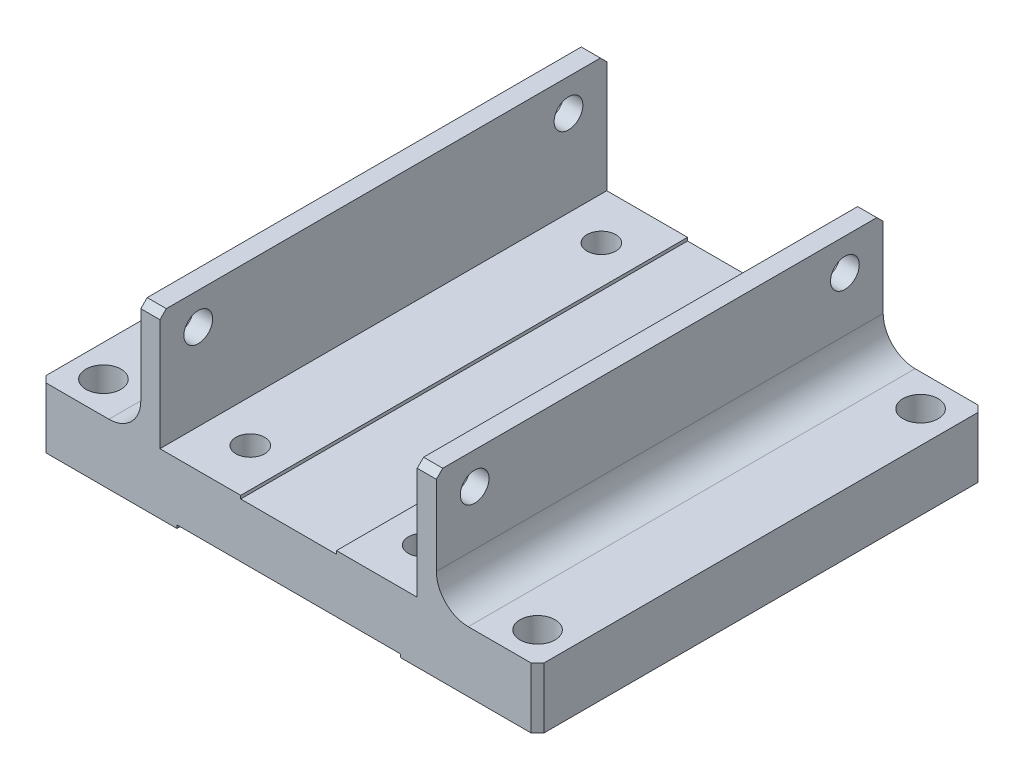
ISO-10303-21;
HEADER;
FILE_DESCRIPTION(('STEP AP214'),'2;1');
FILE_NAME('part.step','',(''),(''),'','','');
FILE_SCHEMA(('AUTOMOTIVE_DESIGN { 1 0 10303 214 1 1 1 1 }'));
ENDSEC;
DATA;
#1=APPLICATION_CONTEXT('core data for automotive mechanical design processes');
#2=APPLICATION_PROTOCOL_DEFINITION('international standard','automotive_design',2000,#1);
#3=PRODUCT_CONTEXT('',#1,'mechanical');
#4=PRODUCT('Part','Part','',(#3));
#5=PRODUCT_RELATED_PRODUCT_CATEGORY('part','',(#4));
#6=PRODUCT_DEFINITION_FORMATION('','',#4);
#7=PRODUCT_DEFINITION_CONTEXT('part definition',#1,'design');
#8=PRODUCT_DEFINITION('design','',#6,#7);
#9=PRODUCT_DEFINITION_SHAPE('','',#8);
#10=(LENGTH_UNIT() NAMED_UNIT(*) SI_UNIT(.MILLI.,.METRE.));
#11=(NAMED_UNIT(*) PLANE_ANGLE_UNIT() SI_UNIT($,.RADIAN.));
#12=(NAMED_UNIT(*) SI_UNIT($,.STERADIAN.) SOLID_ANGLE_UNIT());
#13=UNCERTAINTY_MEASURE_WITH_UNIT(LENGTH_MEASURE(1.E-05),#10,'distance_accuracy_value','');
#14=(GEOMETRIC_REPRESENTATION_CONTEXT(3) GLOBAL_UNCERTAINTY_ASSIGNED_CONTEXT((#13)) GLOBAL_UNIT_ASSIGNED_CONTEXT((#10,
#11,#12)) REPRESENTATION_CONTEXT('',''));
#15=CARTESIAN_POINT('',(0.,0.,0.));
#16=DIRECTION('',(0.,0.,1.));
#17=DIRECTION('',(1.,0.,0.));
#18=AXIS2_PLACEMENT_3D('',#15,#16,#17);
#19=CARTESIAN_POINT('',(17.5,0.,-35.00105));
#20=DIRECTION('',(1.,0.,0.));
#21=DIRECTION('',(0.,1.,0.));
#22=AXIS2_PLACEMENT_3D('',#19,#20,#21);
#23=PLANE('',#22);
#24=CARTESIAN_POINT('',(17.5,0.500000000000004,-35.));
#25=CARTESIAN_POINT('',(17.5,0.500000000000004,35.));
#26=B_SPLINE_CURVE_WITH_KNOTS('',1,(#24,#25),.UNSPECIFIED.,.F.,.F.,(2,2),(0.,1.),.UNSPECIFIED.);
#27=CARTESIAN_POINT('',(17.5,0.500000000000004,27.5));
#28=VERTEX_POINT('',#27);
#29=CARTESIAN_POINT('',(17.5,0.500000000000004,35.));
#30=VERTEX_POINT('',#29);
#31=EDGE_CURVE('E71',#28,#30,#26,.T.);
#32=ORIENTED_EDGE('',*,*,#31,.F.);
#33=CARTESIAN_POINT('',(17.5,0.500000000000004,-27.5));
#34=VERTEX_POINT('',#33);
#35=EDGE_CURVE('E83',#34,#28,#26,.T.);
#36=ORIENTED_EDGE('',*,*,#35,.F.);
#37=CARTESIAN_POINT('',(17.5,0.500000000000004,-35.));
#38=VERTEX_POINT('',#37);
#39=EDGE_CURVE('E26',#38,#34,#26,.T.);
#40=ORIENTED_EDGE('',*,*,#39,.F.);
#41=DIRECTION('',(0.,1.,0.));
#42=VECTOR('',#41,1.);
#43=CARTESIAN_POINT('',(17.5,0.,-35.));
#44=LINE('',#43,#42);
#45=CARTESIAN_POINT('',(17.5,0.,-35.));
#46=VERTEX_POINT('',#45);
#47=EDGE_CURVE('E126',#46,#38,#44,.T.);
#48=ORIENTED_EDGE('',*,*,#47,.F.);
#49=DIRECTION('',(0.,0.,1.));
#50=VECTOR('',#49,1.);
#51=CARTESIAN_POINT('',(17.5,0.,-35.00105));
#52=LINE('',#51,#50);
#53=CARTESIAN_POINT('',(17.5,0.,35.));
#54=VERTEX_POINT('',#53);
#55=EDGE_CURVE('E90',#54,#46,#52,.F.);
#56=ORIENTED_EDGE('',*,*,#55,.F.);
#57=DIRECTION('',(0.,1.,0.));
#58=VECTOR('',#57,1.);
#59=CARTESIAN_POINT('',(17.5,0.,35.));
#60=LINE('',#59,#58);
#61=EDGE_CURVE('E86',#30,#54,#60,.F.);
#62=ORIENTED_EDGE('',*,*,#61,.F.);
#63=EDGE_LOOP('',(#32,#36,#40,#48,#56,#62));
#64=FACE_BOUND('',#63,.T.);
#65=ADVANCED_FACE('F16',(#64),#23,.F.);
#66=CARTESIAN_POINT('',(-39.,9.5,35.));
#67=DIRECTION('',(0.,0.,-1.));
#68=DIRECTION('',(-1.,0.,0.));
#69=AXIS2_PLACEMENT_3D('',#66,#67,#68);
#70=PLANE('',#69);
#71=DIRECTION('',(-1.,0.,0.));
#72=VECTOR('',#71,1.);
#73=CARTESIAN_POINT('',(-39.,27.,35.));
#74=LINE('',#73,#72);
#75=CARTESIAN_POINT('',(-23.15,27.,35.));
#76=VERTEX_POINT('',#75);
#77=CARTESIAN_POINT('',(-20.15,27.,35.));
#78=VERTEX_POINT('',#77);
#79=EDGE_CURVE('E94',#76,#78,#74,.F.);
#80=ORIENTED_EDGE('',*,*,#79,.F.);
#81=DIRECTION('',(0.,1.,0.));
#82=VECTOR('',#81,1.);
#83=CARTESIAN_POINT('',(-23.15,9.5,35.));
#84=LINE('',#83,#82);
#85=CARTESIAN_POINT('',(-23.15,14.5,35.));
#86=VERTEX_POINT('',#85);
#87=EDGE_CURVE('E129',#86,#76,#84,.T.);
#88=ORIENTED_EDGE('',*,*,#87,.F.);
#89=CARTESIAN_POINT('',(-28.15,14.5,35.));
#90=DIRECTION('',(0.,0.,-1.));
#91=DIRECTION('',(-1.,0.,0.));
#92=AXIS2_PLACEMENT_3D('',#89,#90,#91);
#93=CIRCLE('',#92,5.);
#94=CARTESIAN_POINT('',(-28.15,9.5,35.));
#95=VERTEX_POINT('',#94);
#96=EDGE_CURVE('E131',#95,#86,#93,.F.);
#97=ORIENTED_EDGE('',*,*,#96,.F.);
#98=DIRECTION('',(-1.,0.,0.));
#99=VECTOR('',#98,1.);
#100=CARTESIAN_POINT('',(-39.,9.5,35.));
#101=LINE('',#100,#99);
#102=CARTESIAN_POINT('',(-38.,9.5,35.));
#103=VERTEX_POINT('',#102);
#104=EDGE_CURVE('E134',#103,#95,#101,.F.);
#105=ORIENTED_EDGE('',*,*,#104,.F.);
#106=DIRECTION('',(0.,1.,0.));
#107=VECTOR('',#106,1.);
#108=CARTESIAN_POINT('',(-38.,9.5,35.));
#109=LINE('',#108,#107);
#110=CARTESIAN_POINT('',(-38.,0.,35.));
#111=VERTEX_POINT('',#110);
#112=EDGE_CURVE('E137',#111,#103,#109,.T.);
#113=ORIENTED_EDGE('',*,*,#112,.F.);
#114=DIRECTION('',(-1.,0.,0.));
#115=VECTOR('',#114,1.);
#116=CARTESIAN_POINT('',(-39.,0.,35.));
#117=LINE('',#116,#115);
#118=CARTESIAN_POINT('',(-17.5,0.,35.));
#119=VERTEX_POINT('',#118);
#120=EDGE_CURVE('E140',#119,#111,#117,.T.);
#121=ORIENTED_EDGE('',*,*,#120,.F.);
#122=DIRECTION('',(0.,1.,0.));
#123=VECTOR('',#122,1.);
#124=CARTESIAN_POINT('',(-17.5,9.5,35.));
#125=LINE('',#124,#123);
#126=CARTESIAN_POINT('',(-17.4999998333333,0.500000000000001,35.));
#127=VERTEX_POINT('',#126);
#128=EDGE_CURVE('E100',#127,#119,#125,.F.);
#129=ORIENTED_EDGE('',*,*,#128,.F.);
#130=CARTESIAN_POINT('',(17.5,0.500000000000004,35.));
#131=CARTESIAN_POINT('',(-17.5,0.5,35.));
#132=B_SPLINE_CURVE_WITH_KNOTS('',1,(#130,#131),.UNSPECIFIED.,.F.,.F.,(2,2),(0.,1.),.UNSPECIFIED.);
#133=EDGE_CURVE('E75',#30,#127,#132,.T.);
#134=ORIENTED_EDGE('',*,*,#133,.F.);
#135=ORIENTED_EDGE('',*,*,#61,.T.);
#136=DIRECTION('',(-1.,0.,0.));
#137=VECTOR('',#136,1.);
#138=CARTESIAN_POINT('',(-39.,0.,35.));
#139=LINE('',#138,#137);
#140=CARTESIAN_POINT('',(38.,0.,35.));
#141=VERTEX_POINT('',#140);
#142=EDGE_CURVE('E143',#141,#54,#139,.T.);
#143=ORIENTED_EDGE('',*,*,#142,.F.);
#144=DIRECTION('',(0.,1.,0.));
#145=VECTOR('',#144,1.);
#146=CARTESIAN_POINT('',(38.,9.5,35.));
#147=LINE('',#146,#145);
#148=CARTESIAN_POINT('',(38.,9.5,35.));
#149=VERTEX_POINT('',#148);
#150=EDGE_CURVE('E145',#149,#141,#147,.F.);
#151=ORIENTED_EDGE('',*,*,#150,.F.);
#152=DIRECTION('',(-1.,0.,0.));
#153=VECTOR('',#152,1.);
#154=CARTESIAN_POINT('',(-39.,9.5,35.));
#155=LINE('',#154,#153);
#156=CARTESIAN_POINT('',(28.15,9.5,35.));
#157=VERTEX_POINT('',#156);
#158=EDGE_CURVE('E148',#157,#149,#155,.F.);
#159=ORIENTED_EDGE('',*,*,#158,.F.);
#160=CARTESIAN_POINT('',(28.15,14.5,35.));
#161=DIRECTION('',(0.,0.,1.));
#162=DIRECTION('',(1.,0.,0.));
#163=AXIS2_PLACEMENT_3D('',#160,#161,#162);
#164=CIRCLE('',#163,5.);
#165=CARTESIAN_POINT('',(23.15,14.5,35.));
#166=VERTEX_POINT('',#165);
#167=EDGE_CURVE('E151',#166,#157,#164,.T.);
#168=ORIENTED_EDGE('',*,*,#167,.F.);
#169=DIRECTION('',(0.,1.,0.));
#170=VECTOR('',#169,1.);
#171=CARTESIAN_POINT('',(23.15,9.5,35.));
#172=LINE('',#171,#170);
#173=CARTESIAN_POINT('',(23.15,27.,35.));
#174=VERTEX_POINT('',#173);
#175=EDGE_CURVE('E154',#174,#166,#172,.F.);
#176=ORIENTED_EDGE('',*,*,#175,.F.);
#177=DIRECTION('',(-1.,0.,0.));
#178=VECTOR('',#177,1.);
#179=CARTESIAN_POINT('',(-39.,27.,35.));
#180=LINE('',#179,#178);
#181=CARTESIAN_POINT('',(20.15,27.,35.));
#182=VERTEX_POINT('',#181);
#183=EDGE_CURVE('E157',#182,#174,#180,.F.);
#184=ORIENTED_EDGE('',*,*,#183,.F.);
#185=DIRECTION('',(0.,1.,0.));
#186=VECTOR('',#185,1.);
#187=CARTESIAN_POINT('',(20.15,9.5,35.));
#188=LINE('',#187,#186);
#189=CARTESIAN_POINT('',(20.15,9.5,35.));
#190=VERTEX_POINT('',#189);
#191=EDGE_CURVE('E160',#190,#182,#188,.T.);
#192=ORIENTED_EDGE('',*,*,#191,.F.);
#193=DIRECTION('',(-1.,0.,0.));
#194=VECTOR('',#193,1.);
#195=CARTESIAN_POINT('',(-39.,9.5,35.));
#196=LINE('',#195,#194);
#197=CARTESIAN_POINT('',(7.5,9.5,35.));
#198=VERTEX_POINT('',#197);
#199=EDGE_CURVE('E163',#198,#190,#196,.F.);
#200=ORIENTED_EDGE('',*,*,#199,.F.);
#201=DIRECTION('',(0.,1.,0.));
#202=VECTOR('',#201,1.);
#203=CARTESIAN_POINT('',(7.5,9.5,35.));
#204=LINE('',#203,#202);
#205=CARTESIAN_POINT('',(7.5,9.,35.));
#206=VERTEX_POINT('',#205);
#207=EDGE_CURVE('E166',#198,#206,#204,.F.);
#208=ORIENTED_EDGE('',*,*,#207,.T.);
#209=DIRECTION('',(-1.,0.,0.));
#210=VECTOR('',#209,1.);
#211=CARTESIAN_POINT('',(-39.,9.,35.));
#212=LINE('',#211,#210);
#213=CARTESIAN_POINT('',(-7.5,9.,35.));
#214=VERTEX_POINT('',#213);
#215=EDGE_CURVE('E169',#214,#206,#212,.F.);
#216=ORIENTED_EDGE('',*,*,#215,.F.);
#217=DIRECTION('',(0.,-1.,0.));
#218=VECTOR('',#217,1.);
#219=CARTESIAN_POINT('',(-7.5,9.5,35.));
#220=LINE('',#219,#218);
#221=CARTESIAN_POINT('',(-7.5,9.5,35.));
#222=VERTEX_POINT('',#221);
#223=EDGE_CURVE('E172',#214,#222,#220,.F.);
#224=ORIENTED_EDGE('',*,*,#223,.T.);
#225=DIRECTION('',(-1.,0.,0.));
#226=VECTOR('',#225,1.);
#227=CARTESIAN_POINT('',(-39.,9.5,35.));
#228=LINE('',#227,#226);
#229=CARTESIAN_POINT('',(-20.15,9.5,35.));
#230=VERTEX_POINT('',#229);
#231=EDGE_CURVE('E175',#230,#222,#228,.F.);
#232=ORIENTED_EDGE('',*,*,#231,.F.);
#233=DIRECTION('',(0.,1.,0.));
#234=VECTOR('',#233,1.);
#235=CARTESIAN_POINT('',(-20.15,9.5,35.));
#236=LINE('',#235,#234);
#237=EDGE_CURVE('E178',#78,#230,#236,.F.);
#238=ORIENTED_EDGE('',*,*,#237,.F.);
#239=EDGE_LOOP('',(#80,#88,#97,#105,#113,#121,#129,#134,#135,#143,#151,#159,#168,#176,#184,#192,
#200,#208,#216,#224,#232,#238));
#240=FACE_BOUND('',#239,.T.);
#241=ADVANCED_FACE('F97',(#240),#70,.F.);
#242=CARTESIAN_POINT('',(-17.5,0.,-35.00105));
#243=DIRECTION('',(-1.,0.,0.));
#244=DIRECTION('',(0.,0.,1.));
#245=AXIS2_PLACEMENT_3D('',#242,#243,#244);
#246=PLANE('',#245);
#247=CARTESIAN_POINT('',(-17.5,0.5,-35.));
#248=CARTESIAN_POINT('',(-17.5,0.5,35.));
#249=B_SPLINE_CURVE_WITH_KNOTS('',1,(#247,#248),.UNSPECIFIED.,.F.,.F.,(2,2),(0.,1.),.UNSPECIFIED.);
#250=CARTESIAN_POINT('',(-17.5,0.5,-35.));
#251=VERTEX_POINT('',#250);
#252=CARTESIAN_POINT('',(-17.5,0.5,-27.5));
#253=VERTEX_POINT('',#252);
#254=EDGE_CURVE('E34',#251,#253,#249,.T.);
#255=ORIENTED_EDGE('',*,*,#254,.T.);
#256=CARTESIAN_POINT('',(-17.5,0.5,27.5));
#257=VERTEX_POINT('',#256);
#258=EDGE_CURVE('E105',#253,#257,#249,.T.);
#259=ORIENTED_EDGE('',*,*,#258,.T.);
#260=EDGE_CURVE('E102',#257,#127,#249,.T.);
#261=ORIENTED_EDGE('',*,*,#260,.T.);
#262=ORIENTED_EDGE('',*,*,#128,.T.);
#263=DIRECTION('',(0.,0.,1.));
#264=VECTOR('',#263,1.);
#265=CARTESIAN_POINT('',(-17.5,0.,-35.00105));
#266=LINE('',#265,#264);
#267=CARTESIAN_POINT('',(-17.5,0.,-35.));
#268=VERTEX_POINT('',#267);
#269=EDGE_CURVE('E181',#268,#119,#266,.T.);
#270=ORIENTED_EDGE('',*,*,#269,.F.);
#271=DIRECTION('',(0.,1.,0.));
#272=VECTOR('',#271,1.);
#273=CARTESIAN_POINT('',(-17.5,0.,-35.));
#274=LINE('',#273,#272);
#275=EDGE_CURVE('E184',#251,#268,#274,.F.);
#276=ORIENTED_EDGE('',*,*,#275,.F.);
#277=EDGE_LOOP('',(#255,#259,#261,#262,#270,#276));
#278=FACE_BOUND('',#277,.T.);
#279=ADVANCED_FACE('F458',(#278),#246,.F.);
#280=CARTESIAN_POINT('',(-39.,9.5,-35.));
#281=DIRECTION('',(0.,0.,1.));
#282=DIRECTION('',(1.,0.,0.));
#283=AXIS2_PLACEMENT_3D('',#280,#281,#282);
#284=PLANE('',#283);
#285=DIRECTION('',(1.,0.,0.));
#286=VECTOR('',#285,1.);
#287=CARTESIAN_POINT('',(-39.,27.,-35.));
#288=LINE('',#287,#286);
#289=CARTESIAN_POINT('',(-20.15,27.,-35.));
#290=VERTEX_POINT('',#289);
#291=CARTESIAN_POINT('',(-23.15,27.,-35.));
#292=VERTEX_POINT('',#291);
#293=EDGE_CURVE('E185',#290,#292,#288,.F.);
#294=ORIENTED_EDGE('',*,*,#293,.F.);
#295=DIRECTION('',(0.,1.,0.));
#296=VECTOR('',#295,1.);
#297=CARTESIAN_POINT('',(-20.15,9.5,-35.));
#298=LINE('',#297,#296);
#299=CARTESIAN_POINT('',(-20.15,9.5,-35.));
#300=VERTEX_POINT('',#299);
#301=EDGE_CURVE('E188',#300,#290,#298,.T.);
#302=ORIENTED_EDGE('',*,*,#301,.F.);
#303=DIRECTION('',(1.,0.,0.));
#304=VECTOR('',#303,1.);
#305=CARTESIAN_POINT('',(-39.,9.5,-35.));
#306=LINE('',#305,#304);
#307=CARTESIAN_POINT('',(-7.5,9.5,-35.));
#308=VERTEX_POINT('',#307);
#309=EDGE_CURVE('E191',#308,#300,#306,.F.);
#310=ORIENTED_EDGE('',*,*,#309,.F.);
#311=DIRECTION('',(0.,-1.,0.));
#312=VECTOR('',#311,1.);
#313=CARTESIAN_POINT('',(-7.5,9.5,-35.));
#314=LINE('',#313,#312);
#315=CARTESIAN_POINT('',(-7.5,9.00000000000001,-35.));
#316=VERTEX_POINT('',#315);
#317=EDGE_CURVE('E194',#308,#316,#314,.T.);
#318=ORIENTED_EDGE('',*,*,#317,.T.);
#319=DIRECTION('',(1.,0.,0.));
#320=VECTOR('',#319,1.);
#321=CARTESIAN_POINT('',(-39.,9.00000000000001,-35.));
#322=LINE('',#321,#320);
#323=CARTESIAN_POINT('',(7.5,9.00000000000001,-35.));
#324=VERTEX_POINT('',#323);
#325=EDGE_CURVE('E197',#324,#316,#322,.F.);
#326=ORIENTED_EDGE('',*,*,#325,.F.);
#327=DIRECTION('',(0.,1.,0.));
#328=VECTOR('',#327,1.);
#329=CARTESIAN_POINT('',(7.5,9.5,-35.));
#330=LINE('',#329,#328);
#331=CARTESIAN_POINT('',(7.5,9.5,-35.));
#332=VERTEX_POINT('',#331);
#333=EDGE_CURVE('E200',#324,#332,#330,.T.);
#334=ORIENTED_EDGE('',*,*,#333,.T.);
#335=DIRECTION('',(1.,0.,0.));
#336=VECTOR('',#335,1.);
#337=CARTESIAN_POINT('',(-39.,9.5,-35.));
#338=LINE('',#337,#336);
#339=CARTESIAN_POINT('',(20.15,9.5,-35.));
#340=VERTEX_POINT('',#339);
#341=EDGE_CURVE('E203',#340,#332,#338,.F.);
#342=ORIENTED_EDGE('',*,*,#341,.F.);
#343=DIRECTION('',(0.,1.,0.));
#344=VECTOR('',#343,1.);
#345=CARTESIAN_POINT('',(20.15,9.5,-35.));
#346=LINE('',#345,#344);
#347=CARTESIAN_POINT('',(20.15,27.,-35.));
#348=VERTEX_POINT('',#347);
#349=EDGE_CURVE('E206',#348,#340,#346,.F.);
#350=ORIENTED_EDGE('',*,*,#349,.F.);
#351=DIRECTION('',(1.,0.,0.));
#352=VECTOR('',#351,1.);
#353=CARTESIAN_POINT('',(-39.,27.,-35.));
#354=LINE('',#353,#352);
#355=CARTESIAN_POINT('',(23.15,27.,-35.));
#356=VERTEX_POINT('',#355);
#357=EDGE_CURVE('E209',#356,#348,#354,.F.);
#358=ORIENTED_EDGE('',*,*,#357,.F.);
#359=DIRECTION('',(0.,1.,0.));
#360=VECTOR('',#359,1.);
#361=CARTESIAN_POINT('',(23.15,9.5,-35.));
#362=LINE('',#361,#360);
#363=CARTESIAN_POINT('',(23.15,14.5,-35.));
#364=VERTEX_POINT('',#363);
#365=EDGE_CURVE('E212',#364,#356,#362,.T.);
#366=ORIENTED_EDGE('',*,*,#365,.F.);
#367=CARTESIAN_POINT('',(28.15,14.5,-35.));
#368=DIRECTION('',(0.,0.,1.));
#369=DIRECTION('',(1.,0.,0.));
#370=AXIS2_PLACEMENT_3D('',#367,#368,#369);
#371=CIRCLE('',#370,5.);
#372=CARTESIAN_POINT('',(28.15,9.5,-35.));
#373=VERTEX_POINT('',#372);
#374=EDGE_CURVE('E215',#373,#364,#371,.F.);
#375=ORIENTED_EDGE('',*,*,#374,.F.);
#376=DIRECTION('',(1.,0.,0.));
#377=VECTOR('',#376,1.);
#378=CARTESIAN_POINT('',(-39.,9.5,-35.));
#379=LINE('',#378,#377);
#380=CARTESIAN_POINT('',(37.9999999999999,9.5,-35.));
#381=VERTEX_POINT('',#380);
#382=EDGE_CURVE('E218',#381,#373,#379,.F.);
#383=ORIENTED_EDGE('',*,*,#382,.F.);
#384=DIRECTION('',(0.,1.,0.));
#385=VECTOR('',#384,1.);
#386=CARTESIAN_POINT('',(37.9999999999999,9.5,-35.));
#387=LINE('',#386,#385);
#388=CARTESIAN_POINT('',(37.9999999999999,0.,-35.));
#389=VERTEX_POINT('',#388);
#390=EDGE_CURVE('E221',#389,#381,#387,.T.);
#391=ORIENTED_EDGE('',*,*,#390,.F.);
#392=DIRECTION('',(1.,0.,0.));
#393=VECTOR('',#392,1.);
#394=CARTESIAN_POINT('',(-39.,0.,-35.));
#395=LINE('',#394,#393);
#396=EDGE_CURVE('E224',#46,#389,#395,.T.);
#397=ORIENTED_EDGE('',*,*,#396,.F.);
#398=ORIENTED_EDGE('',*,*,#47,.T.);
#399=CARTESIAN_POINT('',(-17.5,0.5,-35.));
#400=CARTESIAN_POINT('',(17.5,0.500000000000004,-35.));
#401=B_SPLINE_CURVE_WITH_KNOTS('',1,(#399,#400),.UNSPECIFIED.,.F.,.F.,(2,2),(0.,1.),.UNSPECIFIED.);
#402=EDGE_CURVE('E10',#251,#38,#401,.T.);
#403=ORIENTED_EDGE('',*,*,#402,.F.);
#404=ORIENTED_EDGE('',*,*,#275,.T.);
#405=DIRECTION('',(1.,0.,0.));
#406=VECTOR('',#405,1.);
#407=CARTESIAN_POINT('',(-39.,0.,-35.));
#408=LINE('',#407,#406);
#409=CARTESIAN_POINT('',(-37.9999999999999,0.,-35.));
#410=VERTEX_POINT('',#409);
#411=EDGE_CURVE('E227',#410,#268,#408,.T.);
#412=ORIENTED_EDGE('',*,*,#411,.F.);
#413=DIRECTION('',(0.,1.,0.));
#414=VECTOR('',#413,1.);
#415=CARTESIAN_POINT('',(-37.9999999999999,9.5,-35.));
#416=LINE('',#415,#414);
#417=CARTESIAN_POINT('',(-37.9999999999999,9.5,-35.));
#418=VERTEX_POINT('',#417);
#419=EDGE_CURVE('E230',#418,#410,#416,.F.);
#420=ORIENTED_EDGE('',*,*,#419,.F.);
#421=DIRECTION('',(1.,0.,0.));
#422=VECTOR('',#421,1.);
#423=CARTESIAN_POINT('',(-39.,9.5,-35.));
#424=LINE('',#423,#422);
#425=CARTESIAN_POINT('',(-28.15,9.5,-35.));
#426=VERTEX_POINT('',#425);
#427=EDGE_CURVE('E233',#426,#418,#424,.F.);
#428=ORIENTED_EDGE('',*,*,#427,.F.);
#429=CARTESIAN_POINT('',(-28.15,14.5,-35.));
#430=DIRECTION('',(0.,0.,-1.));
#431=DIRECTION('',(-1.,0.,0.));
#432=AXIS2_PLACEMENT_3D('',#429,#430,#431);
#433=CIRCLE('',#432,5.);
#434=CARTESIAN_POINT('',(-23.15,14.5,-35.));
#435=VERTEX_POINT('',#434);
#436=EDGE_CURVE('E236',#435,#426,#433,.T.);
#437=ORIENTED_EDGE('',*,*,#436,.F.);
#438=DIRECTION('',(0.,1.,0.));
#439=VECTOR('',#438,1.);
#440=CARTESIAN_POINT('',(-23.15,9.5,-35.));
#441=LINE('',#440,#439);
#442=EDGE_CURVE('E239',#292,#435,#441,.F.);
#443=ORIENTED_EDGE('',*,*,#442,.F.);
#444=EDGE_LOOP('',(#294,#302,#310,#318,#326,#334,#342,#350,#358,#366,#375,#383,#391,#397,#398,
#403,#404,#412,#420,#428,#437,#443));
#445=FACE_BOUND('',#444,.T.);
#446=ADVANCED_FACE('F504',(#445),#284,.F.);
#447=CARTESIAN_POINT('',(0.,28.,-34.));
#448=DIRECTION('',(0.,0.707106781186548,-0.707106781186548));
#449=DIRECTION('',(0.,0.707106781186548,0.707106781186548));
#450=AXIS2_PLACEMENT_3D('',#447,#448,#449);
#451=PLANE('',#450);
#452=DIRECTION('',(0.,-0.707106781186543,-0.707106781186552));
#453=VECTOR('',#452,1.);
#454=CARTESIAN_POINT('',(-23.15,28.,-34.));
#455=LINE('',#454,#453);
#456=CARTESIAN_POINT('',(-23.15,28.,-34.));
#457=VERTEX_POINT('',#456);
#458=EDGE_CURVE('E242',#457,#292,#455,.T.);
#459=ORIENTED_EDGE('',*,*,#458,.F.);
#460=DIRECTION('',(1.,0.,0.));
#461=VECTOR('',#460,1.);
#462=CARTESIAN_POINT('',(0.,28.,-34.));
#463=LINE('',#462,#461);
#464=CARTESIAN_POINT('',(-20.15,28.,-34.));
#465=VERTEX_POINT('',#464);
#466=EDGE_CURVE('E245',#457,#465,#463,.T.);
#467=ORIENTED_EDGE('',*,*,#466,.T.);
#468=DIRECTION('',(0.,0.707106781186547,0.707106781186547));
#469=VECTOR('',#468,1.);
#470=CARTESIAN_POINT('',(-20.15,27.,-35.));
#471=LINE('',#470,#469);
#472=EDGE_CURVE('E248',#290,#465,#471,.T.);
#473=ORIENTED_EDGE('',*,*,#472,.F.);
#474=ORIENTED_EDGE('',*,*,#293,.T.);
#475=EDGE_LOOP('',(#459,#467,#473,#474));
#476=FACE_BOUND('',#475,.T.);
#477=ADVANCED_FACE('F507',(#476),#451,.T.);
#478=CARTESIAN_POINT('',(-20.15,23.,-30.));
#479=DIRECTION('',(1.,0.,0.));
#480=DIRECTION('',(0.,0.,-1.));
#481=AXIS2_PLACEMENT_3D('',#478,#479,#480);
#482=PLANE('',#481);
#483=CARTESIAN_POINT('',(-20.15,23.0000000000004,29.0000000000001));
#484=DIRECTION('',(-1.,0.,0.));
#485=DIRECTION('',(0.,0.,1.));
#486=AXIS2_PLACEMENT_3D('',#483,#484,#485);
#487=CIRCLE('',#486,2.25);
#488=CARTESIAN_POINT('',(-20.15,23.0000000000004,31.2500000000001));
#489=VERTEX_POINT('',#488);
#490=EDGE_CURVE('E251',#489,#489,#487,.T.);
#491=ORIENTED_EDGE('',*,*,#490,.T.);
#492=EDGE_LOOP('',(#491));
#493=FACE_BOUND('',#492,.T.);
#494=CARTESIAN_POINT('',(-20.15,23.,-29.));
#495=DIRECTION('',(-1.,0.,0.));
#496=DIRECTION('',(0.,0.,1.));
#497=AXIS2_PLACEMENT_3D('',#494,#495,#496);
#498=CIRCLE('',#497,2.25);
#499=CARTESIAN_POINT('',(-20.15,23.,-26.75));
#500=VERTEX_POINT('',#499);
#501=EDGE_CURVE('E254',#500,#500,#498,.T.);
#502=ORIENTED_EDGE('',*,*,#501,.T.);
#503=EDGE_LOOP('',(#502));
#504=FACE_BOUND('',#503,.T.);
#505=ORIENTED_EDGE('',*,*,#237,.T.);
#506=DIRECTION('',(0.,0.,-1.));
#507=VECTOR('',#506,1.);
#508=CARTESIAN_POINT('',(-20.15,9.5,-30.));
#509=LINE('',#508,#507);
#510=EDGE_CURVE('E257',#230,#300,#509,.T.);
#511=ORIENTED_EDGE('',*,*,#510,.T.);
#512=ORIENTED_EDGE('',*,*,#301,.T.);
#513=ORIENTED_EDGE('',*,*,#472,.T.);
#514=DIRECTION('',(0.,0.,-1.));
#515=VECTOR('',#514,1.);
#516=CARTESIAN_POINT('',(-20.15,28.,-30.));
#517=LINE('',#516,#515);
#518=CARTESIAN_POINT('',(-20.15,28.,34.));
#519=VERTEX_POINT('',#518);
#520=EDGE_CURVE('E260',#465,#519,#517,.F.);
#521=ORIENTED_EDGE('',*,*,#520,.T.);
#522=DIRECTION('',(0.,-0.70710678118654,0.707106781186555));
#523=VECTOR('',#522,1.);
#524=CARTESIAN_POINT('',(-20.15,28.,34.));
#525=LINE('',#524,#523);
#526=EDGE_CURVE('E263',#519,#78,#525,.T.);
#527=ORIENTED_EDGE('',*,*,#526,.T.);
#528=EDGE_LOOP('',(#505,#511,#512,#513,#521,#527));
#529=FACE_BOUND('',#528,.T.);
#530=ADVANCED_FACE('F511',(#493,#504,#529),#482,.T.);
#531=CARTESIAN_POINT('',(0.,9.5,0.));
#532=DIRECTION('',(0.,1.,0.));
#533=DIRECTION('',(0.,0.,1.));
#534=AXIS2_PLACEMENT_3D('',#531,#532,#533);
#535=PLANE('',#534);
#536=DIRECTION('',(0.,0.,1.));
#537=VECTOR('',#536,1.);
#538=CARTESIAN_POINT('',(-7.5,9.5,0.));
#539=LINE('',#538,#537);
#540=EDGE_CURVE('E266',#222,#308,#539,.F.);
#541=ORIENTED_EDGE('',*,*,#540,.T.);
#542=ORIENTED_EDGE('',*,*,#309,.T.);
#543=ORIENTED_EDGE('',*,*,#510,.F.);
#544=ORIENTED_EDGE('',*,*,#231,.T.);
#545=EDGE_LOOP('',(#541,#542,#543,#544));
#546=FACE_BOUND('',#545,.T.);
#547=CARTESIAN_POINT('',(-13.5,9.5,27.5));
#548=DIRECTION('',(0.,-1.,0.));
#549=DIRECTION('',(0.,0.,-1.));
#550=AXIS2_PLACEMENT_3D('',#547,#548,#549);
#551=CIRCLE('',#550,2.25);
#552=CARTESIAN_POINT('',(-13.5,9.5,25.25));
#553=VERTEX_POINT('',#552);
#554=EDGE_CURVE('E269',#553,#553,#551,.T.);
#555=ORIENTED_EDGE('',*,*,#554,.T.);
#556=EDGE_LOOP('',(#555));
#557=FACE_BOUND('',#556,.T.);
#558=CARTESIAN_POINT('',(-13.5,9.5,-27.5));
#559=DIRECTION('',(0.,-1.,0.));
#560=DIRECTION('',(0.,0.,-1.));
#561=AXIS2_PLACEMENT_3D('',#558,#559,#560);
#562=CIRCLE('',#561,2.25);
#563=CARTESIAN_POINT('',(-13.5,9.5,-29.75));
#564=VERTEX_POINT('',#563);
#565=EDGE_CURVE('E272',#564,#564,#562,.T.);
#566=ORIENTED_EDGE('',*,*,#565,.T.);
#567=EDGE_LOOP('',(#566));
#568=FACE_BOUND('',#567,.T.);
#569=ADVANCED_FACE('F515',(#546,#557,#568),#535,.T.);
#570=CARTESIAN_POINT('',(-7.5,9.5,-35.00105));
#571=DIRECTION('',(-1.,0.,0.));
#572=DIRECTION('',(0.,-1.,0.));
#573=AXIS2_PLACEMENT_3D('',#570,#571,#572);
#574=PLANE('',#573);
#575=ORIENTED_EDGE('',*,*,#223,.F.);
#576=DIRECTION('',(0.,0.,1.));
#577=VECTOR('',#576,1.);
#578=CARTESIAN_POINT('',(-7.5,9.,-35.00105));
#579=LINE('',#578,#577);
#580=EDGE_CURVE('E275',#214,#316,#579,.F.);
#581=ORIENTED_EDGE('',*,*,#580,.T.);
#582=ORIENTED_EDGE('',*,*,#317,.F.);
#583=ORIENTED_EDGE('',*,*,#540,.F.);
#584=EDGE_LOOP('',(#575,#581,#582,#583));
#585=FACE_BOUND('',#584,.T.);
#586=ADVANCED_FACE('F519',(#585),#574,.F.);
#587=CARTESIAN_POINT('',(-7.5,9.,-35.00105));
#588=DIRECTION('',(0.,-1.,0.));
#589=DIRECTION('',(1.,0.,0.));
#590=AXIS2_PLACEMENT_3D('',#587,#588,#589);
#591=PLANE('',#590);
#592=ORIENTED_EDGE('',*,*,#580,.F.);
#593=ORIENTED_EDGE('',*,*,#215,.T.);
#594=DIRECTION('',(0.,0.,1.));
#595=VECTOR('',#594,1.);
#596=CARTESIAN_POINT('',(7.5,9.00000000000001,-35.00105));
#597=LINE('',#596,#595);
#598=EDGE_CURVE('E278',#324,#206,#597,.T.);
#599=ORIENTED_EDGE('',*,*,#598,.F.);
#600=ORIENTED_EDGE('',*,*,#325,.T.);
#601=EDGE_LOOP('',(#592,#593,#599,#600));
#602=FACE_BOUND('',#601,.T.);
#603=ADVANCED_FACE('F523',(#602),#591,.F.);
#604=CARTESIAN_POINT('',(7.5,9.5,-35.00105));
#605=DIRECTION('',(1.,0.,0.));
#606=DIRECTION('',(0.,1.,0.));
#607=AXIS2_PLACEMENT_3D('',#604,#605,#606);
#608=PLANE('',#607);
#609=ORIENTED_EDGE('',*,*,#207,.F.);
#610=DIRECTION('',(0.,0.,1.));
#611=VECTOR('',#610,1.);
#612=CARTESIAN_POINT('',(7.5,9.5,0.));
#613=LINE('',#612,#611);
#614=EDGE_CURVE('E281',#332,#198,#613,.T.);
#615=ORIENTED_EDGE('',*,*,#614,.F.);
#616=ORIENTED_EDGE('',*,*,#333,.F.);
#617=ORIENTED_EDGE('',*,*,#598,.T.);
#618=EDGE_LOOP('',(#609,#615,#616,#617));
#619=FACE_BOUND('',#618,.T.);
#620=ADVANCED_FACE('F527',(#619),#608,.F.);
#621=CARTESIAN_POINT('',(0.,9.5,0.));
#622=DIRECTION('',(0.,1.,0.));
#623=DIRECTION('',(0.,0.,1.));
#624=AXIS2_PLACEMENT_3D('',#621,#622,#623);
#625=PLANE('',#624);
#626=ORIENTED_EDGE('',*,*,#614,.T.);
#627=ORIENTED_EDGE('',*,*,#199,.T.);
#628=DIRECTION('',(0.,0.,1.));
#629=VECTOR('',#628,1.);
#630=CARTESIAN_POINT('',(20.15,9.5,30.));
#631=LINE('',#630,#629);
#632=EDGE_CURVE('E284',#340,#190,#631,.T.);
#633=ORIENTED_EDGE('',*,*,#632,.F.);
#634=ORIENTED_EDGE('',*,*,#341,.T.);
#635=EDGE_LOOP('',(#626,#627,#633,#634));
#636=FACE_BOUND('',#635,.T.);
#637=CARTESIAN_POINT('',(13.5,9.5,27.5));
#638=DIRECTION('',(0.,-1.,0.));
#639=DIRECTION('',(0.,0.,-1.));
#640=AXIS2_PLACEMENT_3D('',#637,#638,#639);
#641=CIRCLE('',#640,2.25);
#642=CARTESIAN_POINT('',(13.5,9.5,25.25));
#643=VERTEX_POINT('',#642);
#644=EDGE_CURVE('E287',#643,#643,#641,.T.);
#645=ORIENTED_EDGE('',*,*,#644,.T.);
#646=EDGE_LOOP('',(#645));
#647=FACE_BOUND('',#646,.T.);
#648=CARTESIAN_POINT('',(13.5,9.5,-27.5));
#649=DIRECTION('',(0.,-1.,0.));
#650=DIRECTION('',(0.,0.,-1.));
#651=AXIS2_PLACEMENT_3D('',#648,#649,#650);
#652=CIRCLE('',#651,2.25);
#653=CARTESIAN_POINT('',(13.5,9.5,-29.75));
#654=VERTEX_POINT('',#653);
#655=EDGE_CURVE('E290',#654,#654,#652,.T.);
#656=ORIENTED_EDGE('',*,*,#655,.T.);
#657=EDGE_LOOP('',(#656));
#658=FACE_BOUND('',#657,.T.);
#659=ADVANCED_FACE('F531',(#636,#647,#658),#625,.T.);
#660=CARTESIAN_POINT('',(20.15,23.,30.));
#661=DIRECTION('',(-1.,0.,0.));
#662=DIRECTION('',(0.,0.,1.));
#663=AXIS2_PLACEMENT_3D('',#660,#661,#662);
#664=PLANE('',#663);
#665=CARTESIAN_POINT('',(20.15,23.0000000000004,29.0000000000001));
#666=DIRECTION('',(1.,0.,0.));
#667=DIRECTION('',(0.,0.,-1.));
#668=AXIS2_PLACEMENT_3D('',#665,#666,#667);
#669=CIRCLE('',#668,2.25);
#670=CARTESIAN_POINT('',(20.15,23.0000000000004,26.7500000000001));
#671=VERTEX_POINT('',#670);
#672=EDGE_CURVE('E293',#671,#671,#669,.T.);
#673=ORIENTED_EDGE('',*,*,#672,.T.);
#674=EDGE_LOOP('',(#673));
#675=FACE_BOUND('',#674,.T.);
#676=CARTESIAN_POINT('',(20.15,23.,-29.));
#677=DIRECTION('',(1.,0.,0.));
#678=DIRECTION('',(0.,0.,-1.));
#679=AXIS2_PLACEMENT_3D('',#676,#677,#678);
#680=CIRCLE('',#679,2.25);
#681=CARTESIAN_POINT('',(20.15,23.,-31.25));
#682=VERTEX_POINT('',#681);
#683=EDGE_CURVE('E296',#682,#682,#680,.T.);
#684=ORIENTED_EDGE('',*,*,#683,.T.);
#685=EDGE_LOOP('',(#684));
#686=FACE_BOUND('',#685,.T.);
#687=ORIENTED_EDGE('',*,*,#191,.T.);
#688=DIRECTION('',(0.,-0.707106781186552,0.707106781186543));
#689=VECTOR('',#688,1.);
#690=CARTESIAN_POINT('',(20.15,28.,34.));
#691=LINE('',#690,#689);
#692=CARTESIAN_POINT('',(20.15,28.,34.));
#693=VERTEX_POINT('',#692);
#694=EDGE_CURVE('E299',#693,#182,#691,.T.);
#695=ORIENTED_EDGE('',*,*,#694,.F.);
#696=DIRECTION('',(0.,0.,1.));
#697=VECTOR('',#696,1.);
#698=CARTESIAN_POINT('',(20.15,28.,30.));
#699=LINE('',#698,#697);
#700=CARTESIAN_POINT('',(20.15,28.,-34.));
#701=VERTEX_POINT('',#700);
#702=EDGE_CURVE('E302',#693,#701,#699,.F.);
#703=ORIENTED_EDGE('',*,*,#702,.T.);
#704=DIRECTION('',(0.,-0.707106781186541,-0.707106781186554));
#705=VECTOR('',#704,1.);
#706=CARTESIAN_POINT('',(20.15,28.,-34.));
#707=LINE('',#706,#705);
#708=EDGE_CURVE('E305',#701,#348,#707,.T.);
#709=ORIENTED_EDGE('',*,*,#708,.T.);
#710=ORIENTED_EDGE('',*,*,#349,.T.);
#711=ORIENTED_EDGE('',*,*,#632,.T.);
#712=EDGE_LOOP('',(#687,#695,#703,#709,#710,#711));
#713=FACE_BOUND('',#712,.T.);
#714=ADVANCED_FACE('F535',(#675,#686,#713),#664,.T.);
#715=CARTESIAN_POINT('',(-39.,27.,-35.));
#716=DIRECTION('',(0.,0.707106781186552,-0.707106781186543));
#717=DIRECTION('',(0.,0.707106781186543,0.707106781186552));
#718=AXIS2_PLACEMENT_3D('',#715,#716,#717);
#719=PLANE('',#718);
#720=DIRECTION('',(0.,0.707106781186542,0.707106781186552));
#721=VECTOR('',#720,1.);
#722=CARTESIAN_POINT('',(23.15,27.,-35.));
#723=LINE('',#722,#721);
#724=CARTESIAN_POINT('',(23.15,28.,-34.));
#725=VERTEX_POINT('',#724);
#726=EDGE_CURVE('E308',#356,#725,#723,.T.);
#727=ORIENTED_EDGE('',*,*,#726,.F.);
#728=ORIENTED_EDGE('',*,*,#357,.T.);
#729=ORIENTED_EDGE('',*,*,#708,.F.);
#730=DIRECTION('',(1.,0.,0.));
#731=VECTOR('',#730,1.);
#732=CARTESIAN_POINT('',(-39.,28.,-34.));
#733=LINE('',#732,#731);
#734=EDGE_CURVE('E311',#701,#725,#733,.T.);
#735=ORIENTED_EDGE('',*,*,#734,.T.);
#736=EDGE_LOOP('',(#727,#728,#729,#735));
#737=FACE_BOUND('',#736,.T.);
#738=ADVANCED_FACE('F539',(#737),#719,.T.);
#739=CARTESIAN_POINT('',(23.15,23.,30.));
#740=DIRECTION('',(1.,0.,0.));
#741=DIRECTION('',(0.,0.,-1.));
#742=AXIS2_PLACEMENT_3D('',#739,#740,#741);
#743=PLANE('',#742);
#744=CARTESIAN_POINT('',(23.15,23.0000000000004,29.0000000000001));
#745=DIRECTION('',(1.,0.,0.));
#746=DIRECTION('',(0.,0.,-1.));
#747=AXIS2_PLACEMENT_3D('',#744,#745,#746);
#748=CIRCLE('',#747,2.25);
#749=CARTESIAN_POINT('',(23.15,23.0000000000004,26.7500000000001));
#750=VERTEX_POINT('',#749);
#751=EDGE_CURVE('E314',#750,#750,#748,.F.);
#752=ORIENTED_EDGE('',*,*,#751,.T.);
#753=EDGE_LOOP('',(#752));
#754=FACE_BOUND('',#753,.T.);
#755=CARTESIAN_POINT('',(23.15,23.,-29.));
#756=DIRECTION('',(1.,0.,0.));
#757=DIRECTION('',(0.,0.,-1.));
#758=AXIS2_PLACEMENT_3D('',#755,#756,#757);
#759=CIRCLE('',#758,2.25);
#760=CARTESIAN_POINT('',(23.15,23.,-31.25));
#761=VERTEX_POINT('',#760);
#762=EDGE_CURVE('E317',#761,#761,#759,.F.);
#763=ORIENTED_EDGE('',*,*,#762,.T.);
#764=EDGE_LOOP('',(#763));
#765=FACE_BOUND('',#764,.T.);
#766=ORIENTED_EDGE('',*,*,#175,.T.);
#767=DIRECTION('',(0.,0.,1.));
#768=VECTOR('',#767,1.);
#769=CARTESIAN_POINT('',(23.15,14.5,30.));
#770=LINE('',#769,#768);
#771=EDGE_CURVE('E320',#166,#364,#770,.F.);
#772=ORIENTED_EDGE('',*,*,#771,.T.);
#773=ORIENTED_EDGE('',*,*,#365,.T.);
#774=ORIENTED_EDGE('',*,*,#726,.T.);
#775=DIRECTION('',(0.,0.,-1.));
#776=VECTOR('',#775,1.);
#777=CARTESIAN_POINT('',(23.15,28.,30.));
#778=LINE('',#777,#776);
#779=CARTESIAN_POINT('',(23.15,28.,34.));
#780=VERTEX_POINT('',#779);
#781=EDGE_CURVE('E323',#725,#780,#778,.F.);
#782=ORIENTED_EDGE('',*,*,#781,.T.);
#783=DIRECTION('',(0.,-0.707106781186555,0.70710678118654));
#784=VECTOR('',#783,1.);
#785=CARTESIAN_POINT('',(23.15,28.,34.));
#786=LINE('',#785,#784);
#787=EDGE_CURVE('E326',#780,#174,#786,.T.);
#788=ORIENTED_EDGE('',*,*,#787,.T.);
#789=EDGE_LOOP('',(#766,#772,#773,#774,#782,#788));
#790=FACE_BOUND('',#789,.T.);
#791=ADVANCED_FACE('F543',(#754,#765,#790),#743,.T.);
#792=CARTESIAN_POINT('',(28.15,14.5,30.));
#793=DIRECTION('',(0.,0.,1.));
#794=DIRECTION('',(1.,0.,0.));
#795=AXIS2_PLACEMENT_3D('',#792,#793,#794);
#796=CYLINDRICAL_SURFACE('',#795,5.);
#797=DIRECTION('',(0.,0.,1.));
#798=VECTOR('',#797,1.);
#799=CARTESIAN_POINT('',(28.15,9.5,0.));
#800=LINE('',#799,#798);
#801=EDGE_CURVE('E329',#373,#157,#800,.T.);
#802=ORIENTED_EDGE('',*,*,#801,.F.);
#803=ORIENTED_EDGE('',*,*,#374,.T.);
#804=ORIENTED_EDGE('',*,*,#771,.F.);
#805=ORIENTED_EDGE('',*,*,#167,.T.);
#806=EDGE_LOOP('',(#802,#803,#804,#805));
#807=FACE_BOUND('',#806,.T.);
#808=ADVANCED_FACE('F547',(#807),#796,.F.);
#809=CARTESIAN_POINT('',(0.,9.5,0.));
#810=DIRECTION('',(0.,1.,0.));
#811=DIRECTION('',(0.,0.,1.));
#812=AXIS2_PLACEMENT_3D('',#809,#810,#811);
#813=PLANE('',#812);
#814=CARTESIAN_POINT('',(34.,9.5,-30.));
#815=DIRECTION('',(0.,1.,0.));
#816=DIRECTION('',(0.,0.,1.));
#817=AXIS2_PLACEMENT_3D('',#814,#815,#816);
#818=CIRCLE('',#817,2.75);
#819=CARTESIAN_POINT('',(34.,9.5,-27.25));
#820=VERTEX_POINT('',#819);
#821=EDGE_CURVE('E332',#820,#820,#818,.F.);
#822=ORIENTED_EDGE('',*,*,#821,.T.);
#823=EDGE_LOOP('',(#822));
#824=FACE_BOUND('',#823,.T.);
#825=CARTESIAN_POINT('',(34.,9.5,30.));
#826=DIRECTION('',(0.,1.,0.));
#827=DIRECTION('',(0.,0.,1.));
#828=AXIS2_PLACEMENT_3D('',#825,#826,#827);
#829=CIRCLE('',#828,2.75);
#830=CARTESIAN_POINT('',(34.,9.5,32.75));
#831=VERTEX_POINT('',#830);
#832=EDGE_CURVE('E335',#831,#831,#829,.F.);
#833=ORIENTED_EDGE('',*,*,#832,.T.);
#834=EDGE_LOOP('',(#833));
#835=FACE_BOUND('',#834,.T.);
#836=ORIENTED_EDGE('',*,*,#158,.T.);
#837=DIRECTION('',(0.707106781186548,0.,-0.707106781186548));
#838=VECTOR('',#837,1.);
#839=CARTESIAN_POINT('',(39.,9.50000000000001,34.));
#840=LINE('',#839,#838);
#841=CARTESIAN_POINT('',(39.,9.50000000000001,34.));
#842=VERTEX_POINT('',#841);
#843=EDGE_CURVE('E338',#842,#149,#840,.F.);
#844=ORIENTED_EDGE('',*,*,#843,.F.);
#845=DIRECTION('',(0.,0.,1.));
#846=VECTOR('',#845,1.);
#847=CARTESIAN_POINT('',(39.,9.5,0.));
#848=LINE('',#847,#846);
#849=CARTESIAN_POINT('',(39.,9.50000000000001,-33.9999999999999));
#850=VERTEX_POINT('',#849);
#851=EDGE_CURVE('E341',#842,#850,#848,.F.);
#852=ORIENTED_EDGE('',*,*,#851,.T.);
#853=DIRECTION('',(-0.707106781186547,0.,-0.707106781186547));
#854=VECTOR('',#853,1.);
#855=CARTESIAN_POINT('',(39.,9.5,-34.));
#856=LINE('',#855,#854);
#857=EDGE_CURVE('E344',#850,#381,#856,.T.);
#858=ORIENTED_EDGE('',*,*,#857,.T.);
#859=ORIENTED_EDGE('',*,*,#382,.T.);
#860=ORIENTED_EDGE('',*,*,#801,.T.);
#861=EDGE_LOOP('',(#836,#844,#852,#858,#859,#860));
#862=FACE_BOUND('',#861,.T.);
#863=ADVANCED_FACE('F551',(#824,#835,#862),#813,.T.);
#864=CARTESIAN_POINT('',(39.,-7.07106781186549,-34.));
#865=DIRECTION('',(0.707106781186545,0.,-0.70710678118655));
#866=DIRECTION('',(-0.70710678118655,0.,-0.707106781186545));
#867=AXIS2_PLACEMENT_3D('',#864,#865,#866);
#868=PLANE('',#867);
#869=ORIENTED_EDGE('',*,*,#857,.F.);
#870=DIRECTION('',(0.,1.,0.));
#871=VECTOR('',#870,1.);
#872=CARTESIAN_POINT('',(39.,-7.07106781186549,-34.));
#873=LINE('',#872,#871);
#874=CARTESIAN_POINT('',(39.,0.,-33.9999999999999));
#875=VERTEX_POINT('',#874);
#876=EDGE_CURVE('E347',#850,#875,#873,.F.);
#877=ORIENTED_EDGE('',*,*,#876,.T.);
#878=DIRECTION('',(-0.707106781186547,0.,-0.707106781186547));
#879=VECTOR('',#878,1.);
#880=CARTESIAN_POINT('',(39.,0.,-34.));
#881=LINE('',#880,#879);
#882=EDGE_CURVE('E350',#875,#389,#881,.T.);
#883=ORIENTED_EDGE('',*,*,#882,.T.);
#884=ORIENTED_EDGE('',*,*,#390,.T.);
#885=EDGE_LOOP('',(#869,#877,#883,#884));
#886=FACE_BOUND('',#885,.T.);
#887=ADVANCED_FACE('F555',(#886),#868,.T.);
#888=CARTESIAN_POINT('',(0.,0.,0.));
#889=DIRECTION('',(0.,1.,0.));
#890=DIRECTION('',(0.,0.,1.));
#891=AXIS2_PLACEMENT_3D('',#888,#889,#890);
#892=PLANE('',#891);
#893=CARTESIAN_POINT('',(34.,0.,-30.));
#894=DIRECTION('',(0.,1.,0.));
#895=DIRECTION('',(0.,0.,1.));
#896=AXIS2_PLACEMENT_3D('',#893,#894,#895);
#897=CIRCLE('',#896,2.75);
#898=CARTESIAN_POINT('',(34.,0.,-27.25));
#899=VERTEX_POINT('',#898);
#900=EDGE_CURVE('E353',#899,#899,#897,.F.);
#901=ORIENTED_EDGE('',*,*,#900,.F.);
#902=EDGE_LOOP('',(#901));
#903=FACE_BOUND('',#902,.T.);
#904=CARTESIAN_POINT('',(34.,0.,30.));
#905=DIRECTION('',(0.,1.,0.));
#906=DIRECTION('',(0.,0.,1.));
#907=AXIS2_PLACEMENT_3D('',#904,#905,#906);
#908=CIRCLE('',#907,2.75);
#909=CARTESIAN_POINT('',(34.,0.,32.75));
#910=VERTEX_POINT('',#909);
#911=EDGE_CURVE('E356',#910,#910,#908,.F.);
#912=ORIENTED_EDGE('',*,*,#911,.F.);
#913=EDGE_LOOP('',(#912));
#914=FACE_BOUND('',#913,.T.);
#915=ORIENTED_EDGE('',*,*,#882,.F.);
#916=DIRECTION('',(0.,0.,1.));
#917=VECTOR('',#916,1.);
#918=CARTESIAN_POINT('',(39.,0.,0.));
#919=LINE('',#918,#917);
#920=CARTESIAN_POINT('',(39.,0.,34.));
#921=VERTEX_POINT('',#920);
#922=EDGE_CURVE('E359',#921,#875,#919,.F.);
#923=ORIENTED_EDGE('',*,*,#922,.F.);
#924=DIRECTION('',(0.707106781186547,0.,-0.707106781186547));
#925=VECTOR('',#924,1.);
#926=CARTESIAN_POINT('',(38.,0.,35.));
#927=LINE('',#926,#925);
#928=EDGE_CURVE('E362',#141,#921,#927,.T.);
#929=ORIENTED_EDGE('',*,*,#928,.F.);
#930=ORIENTED_EDGE('',*,*,#142,.T.);
#931=ORIENTED_EDGE('',*,*,#55,.T.);
#932=ORIENTED_EDGE('',*,*,#396,.T.);
#933=EDGE_LOOP('',(#915,#923,#929,#930,#931,#932));
#934=FACE_BOUND('',#933,.T.);
#935=ADVANCED_FACE('F559',(#903,#914,#934),#892,.F.);
#936=CARTESIAN_POINT('',(0.,0.,0.));
#937=DIRECTION('',(0.,1.,0.));
#938=DIRECTION('',(0.,0.,1.));
#939=AXIS2_PLACEMENT_3D('',#936,#937,#938);
#940=PLANE('',#939);
#941=CARTESIAN_POINT('',(-34.,0.,30.));
#942=DIRECTION('',(0.,1.,0.));
#943=DIRECTION('',(0.,0.,1.));
#944=AXIS2_PLACEMENT_3D('',#941,#942,#943);
#945=CIRCLE('',#944,2.75);
#946=CARTESIAN_POINT('',(-34.,0.,32.75));
#947=VERTEX_POINT('',#946);
#948=EDGE_CURVE('E365',#947,#947,#945,.F.);
#949=ORIENTED_EDGE('',*,*,#948,.F.);
#950=EDGE_LOOP('',(#949));
#951=FACE_BOUND('',#950,.T.);
#952=CARTESIAN_POINT('',(-34.,0.,-30.));
#953=DIRECTION('',(0.,1.,0.));
#954=DIRECTION('',(0.,0.,1.));
#955=AXIS2_PLACEMENT_3D('',#952,#953,#954);
#956=CIRCLE('',#955,2.75);
#957=CARTESIAN_POINT('',(-34.,0.,-27.25));
#958=VERTEX_POINT('',#957);
#959=EDGE_CURVE('E368',#958,#958,#956,.F.);
#960=ORIENTED_EDGE('',*,*,#959,.F.);
#961=EDGE_LOOP('',(#960));
#962=FACE_BOUND('',#961,.T.);
#963=DIRECTION('',(0.707106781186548,0.,0.707106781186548));
#964=VECTOR('',#963,1.);
#965=CARTESIAN_POINT('',(-39.,0.,34.));
#966=LINE('',#965,#964);
#967=CARTESIAN_POINT('',(-39.,0.,34.));
#968=VERTEX_POINT('',#967);
#969=EDGE_CURVE('E371',#968,#111,#966,.T.);
#970=ORIENTED_EDGE('',*,*,#969,.F.);
#971=DIRECTION('',(0.,0.,1.));
#972=VECTOR('',#971,1.);
#973=CARTESIAN_POINT('',(-39.,0.,0.));
#974=LINE('',#973,#972);
#975=CARTESIAN_POINT('',(-39.,0.,-34.));
#976=VERTEX_POINT('',#975);
#977=EDGE_CURVE('E374',#976,#968,#974,.T.);
#978=ORIENTED_EDGE('',*,*,#977,.F.);
#979=DIRECTION('',(-0.707106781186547,0.,0.707106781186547));
#980=VECTOR('',#979,1.);
#981=CARTESIAN_POINT('',(-37.9999999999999,0.,-35.));
#982=LINE('',#981,#980);
#983=EDGE_CURVE('E377',#410,#976,#982,.T.);
#984=ORIENTED_EDGE('',*,*,#983,.F.);
#985=ORIENTED_EDGE('',*,*,#411,.T.);
#986=ORIENTED_EDGE('',*,*,#269,.T.);
#987=ORIENTED_EDGE('',*,*,#120,.T.);
#988=EDGE_LOOP('',(#970,#978,#984,#985,#986,#987));
#989=FACE_BOUND('',#988,.T.);
#990=ADVANCED_FACE('F563',(#951,#962,#989),#940,.F.);
#991=CARTESIAN_POINT('',(-39.,-7.07106781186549,-34.));
#992=DIRECTION('',(-0.707106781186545,0.,-0.70710678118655));
#993=DIRECTION('',(-0.70710678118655,0.,0.707106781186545));
#994=AXIS2_PLACEMENT_3D('',#991,#992,#993);
#995=PLANE('',#994);
#996=DIRECTION('',(-0.707106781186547,0.,0.707106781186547));
#997=VECTOR('',#996,1.);
#998=CARTESIAN_POINT('',(-37.9999999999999,9.5,-35.));
#999=LINE('',#998,#997);
#1000=CARTESIAN_POINT('',(-39.,9.5,-34.));
#1001=VERTEX_POINT('',#1000);
#1002=EDGE_CURVE('E380',#418,#1001,#999,.T.);
#1003=ORIENTED_EDGE('',*,*,#1002,.F.);
#1004=ORIENTED_EDGE('',*,*,#419,.T.);
#1005=ORIENTED_EDGE('',*,*,#983,.T.);
#1006=DIRECTION('',(0.,1.,0.));
#1007=VECTOR('',#1006,1.);
#1008=CARTESIAN_POINT('',(-39.,-7.07106781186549,-34.));
#1009=LINE('',#1008,#1007);
#1010=EDGE_CURVE('E383',#976,#1001,#1009,.T.);
#1011=ORIENTED_EDGE('',*,*,#1010,.T.);
#1012=EDGE_LOOP('',(#1003,#1004,#1005,#1011));
#1013=FACE_BOUND('',#1012,.T.);
#1014=ADVANCED_FACE('F567',(#1013),#995,.T.);
#1015=CARTESIAN_POINT('',(0.,9.5,0.));
#1016=DIRECTION('',(0.,1.,0.));
#1017=DIRECTION('',(0.,0.,1.));
#1018=AXIS2_PLACEMENT_3D('',#1015,#1016,#1017);
#1019=PLANE('',#1018);
#1020=CARTESIAN_POINT('',(-34.,9.5,-30.));
#1021=DIRECTION('',(0.,1.,0.));
#1022=DIRECTION('',(0.,0.,1.));
#1023=AXIS2_PLACEMENT_3D('',#1020,#1021,#1022);
#1024=CIRCLE('',#1023,2.75);
#1025=CARTESIAN_POINT('',(-34.,9.5,-27.25));
#1026=VERTEX_POINT('',#1025);
#1027=EDGE_CURVE('E386',#1026,#1026,#1024,.F.);
#1028=ORIENTED_EDGE('',*,*,#1027,.T.);
#1029=EDGE_LOOP('',(#1028));
#1030=FACE_BOUND('',#1029,.T.);
#1031=CARTESIAN_POINT('',(-34.,9.5,30.));
#1032=DIRECTION('',(0.,1.,0.));
#1033=DIRECTION('',(0.,0.,1.));
#1034=AXIS2_PLACEMENT_3D('',#1031,#1032,#1033);
#1035=CIRCLE('',#1034,2.75);
#1036=CARTESIAN_POINT('',(-34.,9.5,32.75));
#1037=VERTEX_POINT('',#1036);
#1038=EDGE_CURVE('E389',#1037,#1037,#1035,.F.);
#1039=ORIENTED_EDGE('',*,*,#1038,.T.);
#1040=EDGE_LOOP('',(#1039));
#1041=FACE_BOUND('',#1040,.T.);
#1042=ORIENTED_EDGE('',*,*,#427,.T.);
#1043=ORIENTED_EDGE('',*,*,#1002,.T.);
#1044=DIRECTION('',(0.,0.,1.));
#1045=VECTOR('',#1044,1.);
#1046=CARTESIAN_POINT('',(-39.,9.5,0.));
#1047=LINE('',#1046,#1045);
#1048=CARTESIAN_POINT('',(-39.,9.5,34.0000000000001));
#1049=VERTEX_POINT('',#1048);
#1050=EDGE_CURVE('E392',#1001,#1049,#1047,.T.);
#1051=ORIENTED_EDGE('',*,*,#1050,.T.);
#1052=DIRECTION('',(0.707106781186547,0.,0.707106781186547));
#1053=VECTOR('',#1052,1.);
#1054=CARTESIAN_POINT('',(-39.,9.5,34.));
#1055=LINE('',#1054,#1053);
#1056=EDGE_CURVE('E394',#1049,#103,#1055,.T.);
#1057=ORIENTED_EDGE('',*,*,#1056,.T.);
#1058=ORIENTED_EDGE('',*,*,#104,.T.);
#1059=DIRECTION('',(0.,0.,-1.));
#1060=VECTOR('',#1059,1.);
#1061=CARTESIAN_POINT('',(-28.15,9.5,-30.));
#1062=LINE('',#1061,#1060);
#1063=EDGE_CURVE('E397',#95,#426,#1062,.T.);
#1064=ORIENTED_EDGE('',*,*,#1063,.T.);
#1065=EDGE_LOOP('',(#1042,#1043,#1051,#1057,#1058,#1064));
#1066=FACE_BOUND('',#1065,.T.);
#1067=ADVANCED_FACE('F571',(#1030,#1041,#1066),#1019,.T.);
#1068=CARTESIAN_POINT('',(-28.15,14.5,-30.));
#1069=DIRECTION('',(0.,0.,-1.));
#1070=DIRECTION('',(-1.,0.,0.));
#1071=AXIS2_PLACEMENT_3D('',#1068,#1069,#1070);
#1072=CYLINDRICAL_SURFACE('',#1071,5.);
#1073=ORIENTED_EDGE('',*,*,#1063,.F.);
#1074=ORIENTED_EDGE('',*,*,#96,.T.);
#1075=DIRECTION('',(0.,0.,1.));
#1076=VECTOR('',#1075,1.);
#1077=CARTESIAN_POINT('',(-23.15,14.5,-30.));
#1078=LINE('',#1077,#1076);
#1079=EDGE_CURVE('E400',#435,#86,#1078,.T.);
#1080=ORIENTED_EDGE('',*,*,#1079,.F.);
#1081=ORIENTED_EDGE('',*,*,#436,.T.);
#1082=EDGE_LOOP('',(#1073,#1074,#1080,#1081));
#1083=FACE_BOUND('',#1082,.T.);
#1084=ADVANCED_FACE('F575',(#1083),#1072,.F.);
#1085=CARTESIAN_POINT('',(-23.15,23.,-30.));
#1086=DIRECTION('',(-1.,0.,0.));
#1087=DIRECTION('',(0.,0.,1.));
#1088=AXIS2_PLACEMENT_3D('',#1085,#1086,#1087);
#1089=PLANE('',#1088);
#1090=CARTESIAN_POINT('',(-23.15,23.0000000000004,29.0000000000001));
#1091=DIRECTION('',(-1.,0.,0.));
#1092=DIRECTION('',(0.,0.,1.));
#1093=AXIS2_PLACEMENT_3D('',#1090,#1091,#1092);
#1094=CIRCLE('',#1093,2.25);
#1095=CARTESIAN_POINT('',(-23.15,23.0000000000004,31.2500000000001));
#1096=VERTEX_POINT('',#1095);
#1097=EDGE_CURVE('E403',#1096,#1096,#1094,.F.);
#1098=ORIENTED_EDGE('',*,*,#1097,.T.);
#1099=EDGE_LOOP('',(#1098));
#1100=FACE_BOUND('',#1099,.T.);
#1101=CARTESIAN_POINT('',(-23.15,23.,-29.));
#1102=DIRECTION('',(-1.,0.,0.));
#1103=DIRECTION('',(0.,0.,1.));
#1104=AXIS2_PLACEMENT_3D('',#1101,#1102,#1103);
#1105=CIRCLE('',#1104,2.25);
#1106=CARTESIAN_POINT('',(-23.15,23.,-26.75));
#1107=VERTEX_POINT('',#1106);
#1108=EDGE_CURVE('E406',#1107,#1107,#1105,.F.);
#1109=ORIENTED_EDGE('',*,*,#1108,.T.);
#1110=EDGE_LOOP('',(#1109));
#1111=FACE_BOUND('',#1110,.T.);
#1112=ORIENTED_EDGE('',*,*,#87,.T.);
#1113=DIRECTION('',(0.,-0.707106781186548,0.707106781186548));
#1114=VECTOR('',#1113,1.);
#1115=CARTESIAN_POINT('',(-23.15,27.,35.));
#1116=LINE('',#1115,#1114);
#1117=CARTESIAN_POINT('',(-23.15,28.,34.));
#1118=VERTEX_POINT('',#1117);
#1119=EDGE_CURVE('E63',#1118,#76,#1116,.T.);
#1120=ORIENTED_EDGE('',*,*,#1119,.F.);
#1121=DIRECTION('',(0.,0.,1.));
#1122=VECTOR('',#1121,1.);
#1123=CARTESIAN_POINT('',(-23.15,28.,-30.));
#1124=LINE('',#1123,#1122);
#1125=EDGE_CURVE('E410',#1118,#457,#1124,.F.);
#1126=ORIENTED_EDGE('',*,*,#1125,.T.);
#1127=ORIENTED_EDGE('',*,*,#458,.T.);
#1128=ORIENTED_EDGE('',*,*,#442,.T.);
#1129=ORIENTED_EDGE('',*,*,#1079,.T.);
#1130=EDGE_LOOP('',(#1112,#1120,#1126,#1127,#1128,#1129));
#1131=FACE_BOUND('',#1130,.T.);
#1132=ADVANCED_FACE('F579',(#1100,#1111,#1131),#1089,.T.);
#1133=CARTESIAN_POINT('',(-39.,27.,35.));
#1134=DIRECTION('',(0.,0.707106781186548,0.707106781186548));
#1135=DIRECTION('',(0.,-0.707106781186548,0.707106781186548));
#1136=AXIS2_PLACEMENT_3D('',#1133,#1134,#1135);
#1137=PLANE('',#1136);
#1138=ORIENTED_EDGE('',*,*,#1119,.T.);
#1139=ORIENTED_EDGE('',*,*,#79,.T.);
#1140=ORIENTED_EDGE('',*,*,#526,.F.);
#1141=DIRECTION('',(1.,0.,0.));
#1142=VECTOR('',#1141,1.);
#1143=CARTESIAN_POINT('',(-39.,28.,34.));
#1144=LINE('',#1143,#1142);
#1145=EDGE_CURVE('E412',#519,#1118,#1144,.F.);
#1146=ORIENTED_EDGE('',*,*,#1145,.T.);
#1147=EDGE_LOOP('',(#1138,#1139,#1140,#1146));
#1148=FACE_BOUND('',#1147,.T.);
#1149=ADVANCED_FACE('F583',(#1148),#1137,.T.);
#1150=CARTESIAN_POINT('',(-39.,-7.07106781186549,34.));
#1151=DIRECTION('',(-0.707106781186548,0.,0.707106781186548));
#1152=DIRECTION('',(0.707106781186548,0.,0.707106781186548));
#1153=AXIS2_PLACEMENT_3D('',#1150,#1151,#1152);
#1154=PLANE('',#1153);
#1155=ORIENTED_EDGE('',*,*,#1056,.F.);
#1156=DIRECTION('',(0.,1.,0.));
#1157=VECTOR('',#1156,1.);
#1158=CARTESIAN_POINT('',(-39.,-7.07106781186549,34.));
#1159=LINE('',#1158,#1157);
#1160=EDGE_CURVE('E415',#1049,#968,#1159,.F.);
#1161=ORIENTED_EDGE('',*,*,#1160,.T.);
#1162=ORIENTED_EDGE('',*,*,#969,.T.);
#1163=ORIENTED_EDGE('',*,*,#112,.T.);
#1164=EDGE_LOOP('',(#1155,#1161,#1162,#1163));
#1165=FACE_BOUND('',#1164,.T.);
#1166=ADVANCED_FACE('F587',(#1165),#1154,.T.);
#1167=CARTESIAN_POINT('',(39.,-7.07106781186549,34.));
#1168=DIRECTION('',(0.707106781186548,0.,0.707106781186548));
#1169=DIRECTION('',(0.707106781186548,0.,-0.707106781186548));
#1170=AXIS2_PLACEMENT_3D('',#1167,#1168,#1169);
#1171=PLANE('',#1170);
#1172=ORIENTED_EDGE('',*,*,#843,.T.);
#1173=ORIENTED_EDGE('',*,*,#150,.T.);
#1174=ORIENTED_EDGE('',*,*,#928,.T.);
#1175=DIRECTION('',(0.,1.,0.));
#1176=VECTOR('',#1175,1.);
#1177=CARTESIAN_POINT('',(39.,-7.07106781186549,34.));
#1178=LINE('',#1177,#1176);
#1179=EDGE_CURVE('E418',#921,#842,#1178,.T.);
#1180=ORIENTED_EDGE('',*,*,#1179,.T.);
#1181=EDGE_LOOP('',(#1172,#1173,#1174,#1180));
#1182=FACE_BOUND('',#1181,.T.);
#1183=ADVANCED_FACE('F591',(#1182),#1171,.T.);
#1184=CARTESIAN_POINT('',(0.,28.,34.));
#1185=DIRECTION('',(0.,0.707106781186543,0.707106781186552));
#1186=DIRECTION('',(0.,-0.707106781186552,0.707106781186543));
#1187=AXIS2_PLACEMENT_3D('',#1184,#1185,#1186);
#1188=PLANE('',#1187);
#1189=ORIENTED_EDGE('',*,*,#787,.F.);
#1190=DIRECTION('',(1.,0.,0.));
#1191=VECTOR('',#1190,1.);
#1192=CARTESIAN_POINT('',(0.,28.,34.));
#1193=LINE('',#1192,#1191);
#1194=EDGE_CURVE('E421',#780,#693,#1193,.F.);
#1195=ORIENTED_EDGE('',*,*,#1194,.T.);
#1196=ORIENTED_EDGE('',*,*,#694,.T.);
#1197=ORIENTED_EDGE('',*,*,#183,.T.);
#1198=EDGE_LOOP('',(#1189,#1195,#1196,#1197));
#1199=FACE_BOUND('',#1198,.T.);
#1200=ADVANCED_FACE('F595',(#1199),#1188,.T.);
#1201=CARTESIAN_POINT('',(0.,28.,0.));
#1202=DIRECTION('',(0.,1.,0.));
#1203=DIRECTION('',(0.,0.,1.));
#1204=AXIS2_PLACEMENT_3D('',#1201,#1202,#1203);
#1205=PLANE('',#1204);
#1206=ORIENTED_EDGE('',*,*,#1125,.F.);
#1207=ORIENTED_EDGE('',*,*,#1145,.F.);
#1208=ORIENTED_EDGE('',*,*,#520,.F.);
#1209=ORIENTED_EDGE('',*,*,#466,.F.);
#1210=EDGE_LOOP('',(#1206,#1207,#1208,#1209));
#1211=FACE_BOUND('',#1210,.T.);
#1212=ADVANCED_FACE('F599',(#1211),#1205,.T.);
#1213=CARTESIAN_POINT('',(-20.15,23.0000000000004,29.0000000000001));
#1214=DIRECTION('',(-1.,0.,0.));
#1215=DIRECTION('',(0.,0.,1.));
#1216=AXIS2_PLACEMENT_3D('',#1213,#1214,#1215);
#1217=CYLINDRICAL_SURFACE('',#1216,2.25);
#1218=ORIENTED_EDGE('',*,*,#1097,.F.);
#1219=EDGE_LOOP('',(#1218));
#1220=FACE_BOUND('',#1219,.T.);
#1221=ORIENTED_EDGE('',*,*,#490,.F.);
#1222=EDGE_LOOP('',(#1221));
#1223=FACE_BOUND('',#1222,.T.);
#1224=ADVANCED_FACE('F603',(#1220,#1223),#1217,.F.);
#1225=CARTESIAN_POINT('',(-20.15,23.,-29.));
#1226=DIRECTION('',(-1.,0.,0.));
#1227=DIRECTION('',(0.,0.,1.));
#1228=AXIS2_PLACEMENT_3D('',#1225,#1226,#1227);
#1229=CYLINDRICAL_SURFACE('',#1228,2.25);
#1230=ORIENTED_EDGE('',*,*,#1108,.F.);
#1231=EDGE_LOOP('',(#1230));
#1232=FACE_BOUND('',#1231,.T.);
#1233=ORIENTED_EDGE('',*,*,#501,.F.);
#1234=EDGE_LOOP('',(#1233));
#1235=FACE_BOUND('',#1234,.T.);
#1236=ADVANCED_FACE('F607',(#1232,#1235),#1229,.F.);
#1237=CARTESIAN_POINT('',(-13.5,0.,27.5));
#1238=DIRECTION('',(0.,-1.,0.));
#1239=DIRECTION('',(0.,0.,-1.));
#1240=AXIS2_PLACEMENT_3D('',#1237,#1238,#1239);
#1241=CYLINDRICAL_SURFACE('',#1240,2.25);
#1242=ORIENTED_EDGE('',*,*,#554,.F.);
#1243=EDGE_LOOP('',(#1242));
#1244=FACE_BOUND('',#1243,.T.);
#1245=CARTESIAN_POINT('',(-13.5,5.5,27.5));
#1246=DIRECTION('',(0.,-1.,0.));
#1247=DIRECTION('',(0.,0.,-1.));
#1248=AXIS2_PLACEMENT_3D('',#1245,#1246,#1247);
#1249=CIRCLE('',#1248,2.25);
#1250=CARTESIAN_POINT('',(-13.5,5.5,25.25));
#1251=VERTEX_POINT('',#1250);
#1252=EDGE_CURVE('E424',#1251,#1251,#1249,.T.);
#1253=ORIENTED_EDGE('',*,*,#1252,.T.);
#1254=EDGE_LOOP('',(#1253));
#1255=FACE_BOUND('',#1254,.T.);
#1256=ADVANCED_FACE('F611',(#1244,#1255),#1241,.F.);
#1257=CARTESIAN_POINT('',(-13.5,0.,27.5));
#1258=DIRECTION('',(0.,-1.,0.));
#1259=DIRECTION('',(0.,0.,-1.));
#1260=AXIS2_PLACEMENT_3D('',#1257,#1258,#1259);
#1261=CYLINDRICAL_SURFACE('',#1260,4.);
#1262=CARTESIAN_POINT('',(-13.5,0.500000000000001,27.5));
#1263=DIRECTION('',(0.,-1.,0.));
#1264=DIRECTION('',(0.,0.,-1.));
#1265=AXIS2_PLACEMENT_3D('',#1262,#1263,#1264);
#1266=CIRCLE('',#1265,4.);
#1267=EDGE_CURVE('E52',#257,#257,#1266,.T.);
#1268=ORIENTED_EDGE('',*,*,#1267,.T.);
#1269=EDGE_LOOP('',(#1268));
#1270=FACE_BOUND('',#1269,.T.);
#1271=CARTESIAN_POINT('',(-13.5,5.5,27.5));
#1272=DIRECTION('',(0.,-1.,0.));
#1273=DIRECTION('',(0.,0.,-1.));
#1274=AXIS2_PLACEMENT_3D('',#1271,#1272,#1273);
#1275=CIRCLE('',#1274,4.);
#1276=CARTESIAN_POINT('',(-13.5,5.5,23.5));
#1277=VERTEX_POINT('',#1276);
#1278=EDGE_CURVE('E427',#1277,#1277,#1275,.T.);
#1279=ORIENTED_EDGE('',*,*,#1278,.F.);
#1280=EDGE_LOOP('',(#1279));
#1281=FACE_BOUND('',#1280,.T.);
#1282=ADVANCED_FACE('F484',(#1270,#1281),#1261,.F.);
#1283=CARTESIAN_POINT('',(-11.25,5.5,27.5));
#1284=DIRECTION('',(0.,1.,0.));
#1285=DIRECTION('',(0.,0.,1.));
#1286=AXIS2_PLACEMENT_3D('',#1283,#1284,#1285);
#1287=PLANE('',#1286);
#1288=ORIENTED_EDGE('',*,*,#1278,.T.);
#1289=EDGE_LOOP('',(#1288));
#1290=FACE_BOUND('',#1289,.T.);
#1291=ORIENTED_EDGE('',*,*,#1252,.F.);
#1292=EDGE_LOOP('',(#1291));
#1293=FACE_BOUND('',#1292,.T.);
#1294=ADVANCED_FACE('F477',(#1290,#1293),#1287,.F.);
#1295=CARTESIAN_POINT('',(-13.5,0.,-27.5));
#1296=DIRECTION('',(0.,-1.,0.));
#1297=DIRECTION('',(0.,0.,-1.));
#1298=AXIS2_PLACEMENT_3D('',#1295,#1296,#1297);
#1299=CYLINDRICAL_SURFACE('',#1298,2.25);
#1300=ORIENTED_EDGE('',*,*,#565,.F.);
#1301=EDGE_LOOP('',(#1300));
#1302=FACE_BOUND('',#1301,.T.);
#1303=CARTESIAN_POINT('',(-13.5,5.5,-27.5));
#1304=DIRECTION('',(0.,-1.,0.));
#1305=DIRECTION('',(0.,0.,-1.));
#1306=AXIS2_PLACEMENT_3D('',#1303,#1304,#1305);
#1307=CIRCLE('',#1306,2.25);
#1308=CARTESIAN_POINT('',(-13.5,5.5,-29.75));
#1309=VERTEX_POINT('',#1308);
#1310=EDGE_CURVE('E430',#1309,#1309,#1307,.T.);
#1311=ORIENTED_EDGE('',*,*,#1310,.T.);
#1312=EDGE_LOOP('',(#1311));
#1313=FACE_BOUND('',#1312,.T.);
#1314=ADVANCED_FACE('F466',(#1302,#1313),#1299,.F.);
#1315=CARTESIAN_POINT('',(-13.5,0.,-27.5));
#1316=DIRECTION('',(0.,-1.,0.));
#1317=DIRECTION('',(0.,0.,-1.));
#1318=AXIS2_PLACEMENT_3D('',#1315,#1316,#1317);
#1319=CYLINDRICAL_SURFACE('',#1318,4.);
#1320=CARTESIAN_POINT('',(-13.5,0.500000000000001,-27.5));
#1321=DIRECTION('',(0.,-1.,0.));
#1322=DIRECTION('',(0.,0.,-1.));
#1323=AXIS2_PLACEMENT_3D('',#1320,#1321,#1322);
#1324=CIRCLE('',#1323,4.);
#1325=EDGE_CURVE('E20',#253,#253,#1324,.T.);
#1326=ORIENTED_EDGE('',*,*,#1325,.T.);
#1327=EDGE_LOOP('',(#1326));
#1328=FACE_BOUND('',#1327,.T.);
#1329=CARTESIAN_POINT('',(-13.5,5.5,-27.5));
#1330=DIRECTION('',(0.,-1.,0.));
#1331=DIRECTION('',(0.,0.,-1.));
#1332=AXIS2_PLACEMENT_3D('',#1329,#1330,#1331);
#1333=CIRCLE('',#1332,4.);
#1334=CARTESIAN_POINT('',(-13.5,5.5,-31.5));
#1335=VERTEX_POINT('',#1334);
#1336=EDGE_CURVE('E433',#1335,#1335,#1333,.T.);
#1337=ORIENTED_EDGE('',*,*,#1336,.F.);
#1338=EDGE_LOOP('',(#1337));
#1339=FACE_BOUND('',#1338,.T.);
#1340=ADVANCED_FACE('F462',(#1328,#1339),#1319,.F.);
#1341=CARTESIAN_POINT('',(-11.25,5.5,-27.5));
#1342=DIRECTION('',(0.,1.,0.));
#1343=DIRECTION('',(0.,0.,1.));
#1344=AXIS2_PLACEMENT_3D('',#1341,#1342,#1343);
#1345=PLANE('',#1344);
#1346=ORIENTED_EDGE('',*,*,#1336,.T.);
#1347=EDGE_LOOP('',(#1346));
#1348=FACE_BOUND('',#1347,.T.);
#1349=ORIENTED_EDGE('',*,*,#1310,.F.);
#1350=EDGE_LOOP('',(#1349));
#1351=FACE_BOUND('',#1350,.T.);
#1352=ADVANCED_FACE('F465',(#1348,#1351),#1345,.F.);
#1353=CARTESIAN_POINT('',(13.5,0.,27.5));
#1354=DIRECTION('',(0.,-1.,0.));
#1355=DIRECTION('',(0.,0.,-1.));
#1356=AXIS2_PLACEMENT_3D('',#1353,#1354,#1355);
#1357=CYLINDRICAL_SURFACE('',#1356,2.25);
#1358=ORIENTED_EDGE('',*,*,#644,.F.);
#1359=EDGE_LOOP('',(#1358));
#1360=FACE_BOUND('',#1359,.T.);
#1361=CARTESIAN_POINT('',(13.5,5.5,27.5));
#1362=DIRECTION('',(0.,-1.,0.));
#1363=DIRECTION('',(0.,0.,-1.));
#1364=AXIS2_PLACEMENT_3D('',#1361,#1362,#1363);
#1365=CIRCLE('',#1364,2.25);
#1366=CARTESIAN_POINT('',(13.5,5.5,25.25));
#1367=VERTEX_POINT('',#1366);
#1368=EDGE_CURVE('E436',#1367,#1367,#1365,.T.);
#1369=ORIENTED_EDGE('',*,*,#1368,.T.);
#1370=EDGE_LOOP('',(#1369));
#1371=FACE_BOUND('',#1370,.T.);
#1372=ADVANCED_FACE('F472',(#1360,#1371),#1357,.F.);
#1373=CARTESIAN_POINT('',(13.5,0.,27.5));
#1374=DIRECTION('',(0.,-1.,0.));
#1375=DIRECTION('',(0.,0.,-1.));
#1376=AXIS2_PLACEMENT_3D('',#1373,#1374,#1375);
#1377=CYLINDRICAL_SURFACE('',#1376,4.);
#1378=CARTESIAN_POINT('',(13.5,5.5,27.5));
#1379=DIRECTION('',(0.,-1.,0.));
#1380=DIRECTION('',(0.,0.,-1.));
#1381=AXIS2_PLACEMENT_3D('',#1378,#1379,#1380);
#1382=CIRCLE('',#1381,4.);
#1383=CARTESIAN_POINT('',(13.5,5.5,23.5));
#1384=VERTEX_POINT('',#1383);
#1385=EDGE_CURVE('E439',#1384,#1384,#1382,.T.);
#1386=ORIENTED_EDGE('',*,*,#1385,.F.);
#1387=EDGE_LOOP('',(#1386));
#1388=FACE_BOUND('',#1387,.T.);
#1389=CARTESIAN_POINT('',(13.5,0.500000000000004,27.5));
#1390=DIRECTION('',(0.,-1.,0.));
#1391=DIRECTION('',(0.,0.,-1.));
#1392=AXIS2_PLACEMENT_3D('',#1389,#1390,#1391);
#1393=CIRCLE('',#1392,4.);
#1394=EDGE_CURVE('E79',#28,#28,#1393,.T.);
#1395=ORIENTED_EDGE('',*,*,#1394,.T.);
#1396=EDGE_LOOP('',(#1395));
#1397=FACE_BOUND('',#1396,.T.);
#1398=ADVANCED_FACE('F662',(#1388,#1397),#1377,.F.);
#1399=CARTESIAN_POINT('',(15.75,5.5,27.5));
#1400=DIRECTION('',(0.,1.,0.));
#1401=DIRECTION('',(0.,0.,1.));
#1402=AXIS2_PLACEMENT_3D('',#1399,#1400,#1401);
#1403=PLANE('',#1402);
#1404=ORIENTED_EDGE('',*,*,#1385,.T.);
#1405=EDGE_LOOP('',(#1404));
#1406=FACE_BOUND('',#1405,.T.);
#1407=ORIENTED_EDGE('',*,*,#1368,.F.);
#1408=EDGE_LOOP('',(#1407));
#1409=FACE_BOUND('',#1408,.T.);
#1410=ADVANCED_FACE('F672',(#1406,#1409),#1403,.F.);
#1411=CARTESIAN_POINT('',(13.5,0.,-27.5));
#1412=DIRECTION('',(0.,-1.,0.));
#1413=DIRECTION('',(0.,0.,-1.));
#1414=AXIS2_PLACEMENT_3D('',#1411,#1412,#1413);
#1415=CYLINDRICAL_SURFACE('',#1414,2.25);
#1416=ORIENTED_EDGE('',*,*,#655,.F.);
#1417=EDGE_LOOP('',(#1416));
#1418=FACE_BOUND('',#1417,.T.);
#1419=CARTESIAN_POINT('',(13.5,5.5,-27.5));
#1420=DIRECTION('',(0.,-1.,0.));
#1421=DIRECTION('',(0.,0.,-1.));
#1422=AXIS2_PLACEMENT_3D('',#1419,#1420,#1421);
#1423=CIRCLE('',#1422,2.25);
#1424=CARTESIAN_POINT('',(13.5,5.5,-29.75));
#1425=VERTEX_POINT('',#1424);
#1426=EDGE_CURVE('E442',#1425,#1425,#1423,.T.);
#1427=ORIENTED_EDGE('',*,*,#1426,.T.);
#1428=EDGE_LOOP('',(#1427));
#1429=FACE_BOUND('',#1428,.T.);
#1430=ADVANCED_FACE('F682',(#1418,#1429),#1415,.F.);
#1431=CARTESIAN_POINT('',(13.5,0.,-27.5));
#1432=DIRECTION('',(0.,-1.,0.));
#1433=DIRECTION('',(0.,0.,-1.));
#1434=AXIS2_PLACEMENT_3D('',#1431,#1432,#1433);
#1435=CYLINDRICAL_SURFACE('',#1434,4.);
#1436=CARTESIAN_POINT('',(13.5,5.5,-27.5));
#1437=DIRECTION('',(0.,-1.,0.));
#1438=DIRECTION('',(0.,0.,-1.));
#1439=AXIS2_PLACEMENT_3D('',#1436,#1437,#1438);
#1440=CIRCLE('',#1439,4.);
#1441=CARTESIAN_POINT('',(13.5,5.5,-31.5));
#1442=VERTEX_POINT('',#1441);
#1443=EDGE_CURVE('E445',#1442,#1442,#1440,.T.);
#1444=ORIENTED_EDGE('',*,*,#1443,.F.);
#1445=EDGE_LOOP('',(#1444));
#1446=FACE_BOUND('',#1445,.T.);
#1447=CARTESIAN_POINT('',(13.5,0.500000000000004,-27.5));
#1448=DIRECTION('',(0.,-1.,0.));
#1449=DIRECTION('',(0.,0.,-1.));
#1450=AXIS2_PLACEMENT_3D('',#1447,#1448,#1449);
#1451=CIRCLE('',#1450,4.);
#1452=EDGE_CURVE('E115',#34,#34,#1451,.T.);
#1453=ORIENTED_EDGE('',*,*,#1452,.T.);
#1454=EDGE_LOOP('',(#1453));
#1455=FACE_BOUND('',#1454,.T.);
#1456=ADVANCED_FACE('F692',(#1446,#1455),#1435,.F.);
#1457=CARTESIAN_POINT('',(15.75,5.5,-27.5));
#1458=DIRECTION('',(0.,1.,0.));
#1459=DIRECTION('',(0.,0.,1.));
#1460=AXIS2_PLACEMENT_3D('',#1457,#1458,#1459);
#1461=PLANE('',#1460);
#1462=ORIENTED_EDGE('',*,*,#1443,.T.);
#1463=EDGE_LOOP('',(#1462));
#1464=FACE_BOUND('',#1463,.T.);
#1465=ORIENTED_EDGE('',*,*,#1426,.F.);
#1466=EDGE_LOOP('',(#1465));
#1467=FACE_BOUND('',#1466,.T.);
#1468=ADVANCED_FACE('F702',(#1464,#1467),#1461,.F.);
#1469=CARTESIAN_POINT('',(20.15,23.0000000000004,29.0000000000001));
#1470=DIRECTION('',(1.,0.,0.));
#1471=DIRECTION('',(0.,0.,-1.));
#1472=AXIS2_PLACEMENT_3D('',#1469,#1470,#1471);
#1473=CYLINDRICAL_SURFACE('',#1472,2.25);
#1474=ORIENTED_EDGE('',*,*,#672,.F.);
#1475=EDGE_LOOP('',(#1474));
#1476=FACE_BOUND('',#1475,.T.);
#1477=ORIENTED_EDGE('',*,*,#751,.F.);
#1478=EDGE_LOOP('',(#1477));
#1479=FACE_BOUND('',#1478,.T.);
#1480=ADVANCED_FACE('F712',(#1476,#1479),#1473,.F.);
#1481=CARTESIAN_POINT('',(20.15,23.,-29.));
#1482=DIRECTION('',(1.,0.,0.));
#1483=DIRECTION('',(0.,0.,-1.));
#1484=AXIS2_PLACEMENT_3D('',#1481,#1482,#1483);
#1485=CYLINDRICAL_SURFACE('',#1484,2.25);
#1486=ORIENTED_EDGE('',*,*,#683,.F.);
#1487=EDGE_LOOP('',(#1486));
#1488=FACE_BOUND('',#1487,.T.);
#1489=ORIENTED_EDGE('',*,*,#762,.F.);
#1490=EDGE_LOOP('',(#1489));
#1491=FACE_BOUND('',#1490,.T.);
#1492=ADVANCED_FACE('F722',(#1488,#1491),#1485,.F.);
#1493=CARTESIAN_POINT('',(0.,28.,0.));
#1494=DIRECTION('',(0.,1.,0.));
#1495=DIRECTION('',(0.,0.,1.));
#1496=AXIS2_PLACEMENT_3D('',#1493,#1494,#1495);
#1497=PLANE('',#1496);
#1498=ORIENTED_EDGE('',*,*,#702,.F.);
#1499=ORIENTED_EDGE('',*,*,#1194,.F.);
#1500=ORIENTED_EDGE('',*,*,#781,.F.);
#1501=ORIENTED_EDGE('',*,*,#734,.F.);
#1502=EDGE_LOOP('',(#1498,#1499,#1500,#1501));
#1503=FACE_BOUND('',#1502,.T.);
#1504=ADVANCED_FACE('F732',(#1503),#1497,.T.);
#1505=CARTESIAN_POINT('',(34.,9.5,-30.));
#1506=DIRECTION('',(0.,1.,0.));
#1507=DIRECTION('',(0.,0.,1.));
#1508=AXIS2_PLACEMENT_3D('',#1505,#1506,#1507);
#1509=CYLINDRICAL_SURFACE('',#1508,2.75);
#1510=ORIENTED_EDGE('',*,*,#821,.F.);
#1511=EDGE_LOOP('',(#1510));
#1512=FACE_BOUND('',#1511,.T.);
#1513=ORIENTED_EDGE('',*,*,#900,.T.);
#1514=EDGE_LOOP('',(#1513));
#1515=FACE_BOUND('',#1514,.T.);
#1516=ADVANCED_FACE('F742',(#1512,#1515),#1509,.F.);
#1517=CARTESIAN_POINT('',(34.,9.5,30.));
#1518=DIRECTION('',(0.,1.,0.));
#1519=DIRECTION('',(0.,0.,1.));
#1520=AXIS2_PLACEMENT_3D('',#1517,#1518,#1519);
#1521=CYLINDRICAL_SURFACE('',#1520,2.75);
#1522=ORIENTED_EDGE('',*,*,#832,.F.);
#1523=EDGE_LOOP('',(#1522));
#1524=FACE_BOUND('',#1523,.T.);
#1525=ORIENTED_EDGE('',*,*,#911,.T.);
#1526=EDGE_LOOP('',(#1525));
#1527=FACE_BOUND('',#1526,.T.);
#1528=ADVANCED_FACE('F752',(#1524,#1527),#1521,.F.);
#1529=CARTESIAN_POINT('',(39.,9.5,-35.));
#1530=DIRECTION('',(-1.,0.,0.));
#1531=DIRECTION('',(0.,0.,1.));
#1532=AXIS2_PLACEMENT_3D('',#1529,#1530,#1531);
#1533=PLANE('',#1532);
#1534=ORIENTED_EDGE('',*,*,#1179,.F.);
#1535=ORIENTED_EDGE('',*,*,#922,.T.);
#1536=ORIENTED_EDGE('',*,*,#876,.F.);
#1537=ORIENTED_EDGE('',*,*,#851,.F.);
#1538=EDGE_LOOP('',(#1534,#1535,#1536,#1537));
#1539=FACE_BOUND('',#1538,.T.);
#1540=ADVANCED_FACE('F762',(#1539),#1533,.F.);
#1541=CARTESIAN_POINT('',(-34.,9.5,30.));
#1542=DIRECTION('',(0.,1.,0.));
#1543=DIRECTION('',(0.,0.,1.));
#1544=AXIS2_PLACEMENT_3D('',#1541,#1542,#1543);
#1545=CYLINDRICAL_SURFACE('',#1544,2.75);
#1546=ORIENTED_EDGE('',*,*,#948,.T.);
#1547=EDGE_LOOP('',(#1546));
#1548=FACE_BOUND('',#1547,.T.);
#1549=ORIENTED_EDGE('',*,*,#1038,.F.);
#1550=EDGE_LOOP('',(#1549));
#1551=FACE_BOUND('',#1550,.T.);
#1552=ADVANCED_FACE('F772',(#1548,#1551),#1545,.F.);
#1553=CARTESIAN_POINT('',(-34.,9.5,-30.));
#1554=DIRECTION('',(0.,1.,0.));
#1555=DIRECTION('',(0.,0.,1.));
#1556=AXIS2_PLACEMENT_3D('',#1553,#1554,#1555);
#1557=CYLINDRICAL_SURFACE('',#1556,2.75);
#1558=ORIENTED_EDGE('',*,*,#959,.T.);
#1559=EDGE_LOOP('',(#1558));
#1560=FACE_BOUND('',#1559,.T.);
#1561=ORIENTED_EDGE('',*,*,#1027,.F.);
#1562=EDGE_LOOP('',(#1561));
#1563=FACE_BOUND('',#1562,.T.);
#1564=ADVANCED_FACE('F495',(#1560,#1563),#1557,.F.);
#1565=CARTESIAN_POINT('',(-39.,9.5,-35.));
#1566=DIRECTION('',(1.,0.,0.));
#1567=DIRECTION('',(0.,0.,-1.));
#1568=AXIS2_PLACEMENT_3D('',#1565,#1566,#1567);
#1569=PLANE('',#1568);
#1570=ORIENTED_EDGE('',*,*,#1010,.F.);
#1571=ORIENTED_EDGE('',*,*,#977,.T.);
#1572=ORIENTED_EDGE('',*,*,#1160,.F.);
#1573=ORIENTED_EDGE('',*,*,#1050,.F.);
#1574=EDGE_LOOP('',(#1570,#1571,#1572,#1573));
#1575=FACE_BOUND('',#1574,.T.);
#1576=ADVANCED_FACE('F18',(#1575),#1569,.F.);
#1577=CARTESIAN_POINT('',(-17.5,0.5,-35.00105));
#1578=DIRECTION('',(0.,1.,0.));
#1579=DIRECTION('',(-1.,0.,0.));
#1580=AXIS2_PLACEMENT_3D('',#1577,#1578,#1579);
#1581=PLANE('',#1580);
#1582=ORIENTED_EDGE('',*,*,#254,.F.);
#1583=ORIENTED_EDGE('',*,*,#402,.T.);
#1584=ORIENTED_EDGE('',*,*,#39,.T.);
#1585=ORIENTED_EDGE('',*,*,#1452,.F.);
#1586=ORIENTED_EDGE('',*,*,#35,.T.);
#1587=ORIENTED_EDGE('',*,*,#1394,.F.);
#1588=ORIENTED_EDGE('',*,*,#31,.T.);
#1589=ORIENTED_EDGE('',*,*,#133,.T.);
#1590=ORIENTED_EDGE('',*,*,#260,.F.);
#1591=ORIENTED_EDGE('',*,*,#1267,.F.);
#1592=ORIENTED_EDGE('',*,*,#258,.F.);
#1593=ORIENTED_EDGE('',*,*,#1325,.F.);
#1594=EDGE_LOOP('',(#1582,#1583,#1584,#1585,#1586,#1587,#1588,#1589,#1590,#1591,#1592,#1593));
#1595=FACE_BOUND('',#1594,.T.);
#1596=ADVANCED_FACE('F73',(#1595),#1581,.F.);
#1597=CLOSED_SHELL('',(#65,#241,#279,#446,#477,#530,#569,#586,#603,#620,#659,#714,#738,#791,
#808,#863,#887,#935,#990,#1014,#1067,#1084,#1132,#1149,#1166,#1183,#1200,#1212,#1224,#1236,
#1256,#1282,#1294,#1314,#1340,#1352,#1372,#1398,#1410,#1430,#1456,#1468,#1480,#1492,#1504,#1516,
#1528,#1540,#1552,#1564,#1576,#1596));
#1598=MANIFOLD_SOLID_BREP('B1',#1597);
#1599=ADVANCED_BREP_SHAPE_REPRESENTATION('',(#18,#1598),#14);
#1600=SHAPE_DEFINITION_REPRESENTATION(#9,#1599);
ENDSEC;
END-ISO-10303-21;
